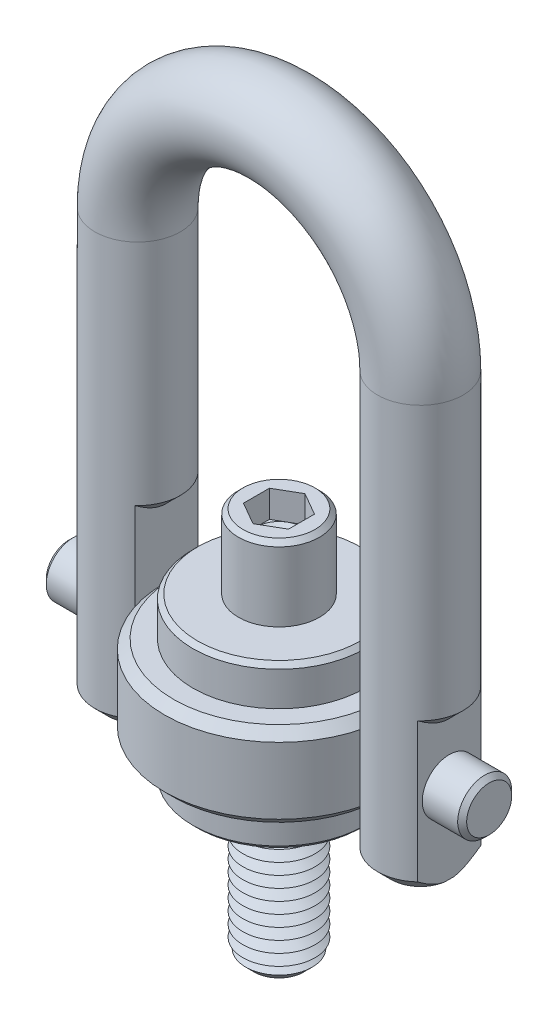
ISO-10303-21;
HEADER;
FILE_DESCRIPTION(('STEP AP214'),'2;1');
FILE_NAME('part.step','',(''),(''),'','','');
FILE_SCHEMA(('AUTOMOTIVE_DESIGN { 1 0 10303 214 1 1 1 1 }'));
ENDSEC;
DATA;
#1=APPLICATION_CONTEXT('core data for automotive mechanical design processes');
#2=APPLICATION_PROTOCOL_DEFINITION('international standard','automotive_design',2000,#1);
#3=PRODUCT_CONTEXT('',#1,'mechanical');
#4=PRODUCT('Part','Part','',(#3));
#5=PRODUCT_RELATED_PRODUCT_CATEGORY('part','',(#4));
#6=PRODUCT_DEFINITION_FORMATION('','',#4);
#7=PRODUCT_DEFINITION_CONTEXT('part definition',#1,'design');
#8=PRODUCT_DEFINITION('design','',#6,#7);
#9=PRODUCT_DEFINITION_SHAPE('','',#8);
#10=(LENGTH_UNIT() NAMED_UNIT(*) SI_UNIT(.MILLI.,.METRE.));
#11=(NAMED_UNIT(*) PLANE_ANGLE_UNIT() SI_UNIT($,.RADIAN.));
#12=(NAMED_UNIT(*) SI_UNIT($,.STERADIAN.) SOLID_ANGLE_UNIT());
#13=UNCERTAINTY_MEASURE_WITH_UNIT(LENGTH_MEASURE(1.E-05),#10,'distance_accuracy_value','');
#14=(GEOMETRIC_REPRESENTATION_CONTEXT(3) GLOBAL_UNCERTAINTY_ASSIGNED_CONTEXT((#13)) GLOBAL_UNIT_ASSIGNED_CONTEXT((#10,
#11,#12)) REPRESENTATION_CONTEXT('',''));
#15=CARTESIAN_POINT('',(0.,0.,0.));
#16=DIRECTION('',(0.,0.,1.));
#17=DIRECTION('',(1.,0.,0.));
#18=AXIS2_PLACEMENT_3D('',#15,#16,#17);
#19=CARTESIAN_POINT('',(23.35,0.,0.));
#20=DIRECTION('',(-1.,0.,0.));
#21=DIRECTION('',(0.,0.,1.));
#22=AXIS2_PLACEMENT_3D('',#19,#20,#21);
#23=CYLINDRICAL_SURFACE('',#22,3.);
#24=CARTESIAN_POINT('',(-22.85,0.,0.));
#25=DIRECTION('',(1.,0.,0.));
#26=DIRECTION('',(0.,0.,-1.));
#27=AXIS2_PLACEMENT_3D('',#24,#25,#26);
#28=CIRCLE('',#27,3.);
#29=CARTESIAN_POINT('',(-22.85,0.,-3.));
#30=VERTEX_POINT('',#29);
#31=EDGE_CURVE('P0_E25',#30,#30,#28,.T.);
#32=ORIENTED_EDGE('',*,*,#31,.T.);
#33=EDGE_LOOP('',(#32));
#34=FACE_BOUND('',#33,.T.);
#35=CARTESIAN_POINT('',(22.85,0.,0.));
#36=DIRECTION('',(1.,0.,0.));
#37=DIRECTION('',(0.,0.,-1.));
#38=AXIS2_PLACEMENT_3D('',#35,#36,#37);
#39=CIRCLE('',#38,3.);
#40=CARTESIAN_POINT('',(22.85,0.,-3.));
#41=VERTEX_POINT('',#40);
#42=EDGE_CURVE('P0_E29',#41,#41,#39,.F.);
#43=ORIENTED_EDGE('',*,*,#42,.T.);
#44=EDGE_LOOP('',(#43));
#45=FACE_BOUND('',#44,.T.);
#46=ADVANCED_FACE('P0_F14',(#34,#45),#23,.T.);
#47=CARTESIAN_POINT('',(23.35,0.,0.));
#48=DIRECTION('',(1.,0.,0.));
#49=DIRECTION('',(0.,0.,-1.));
#50=AXIS2_PLACEMENT_3D('',#47,#48,#49);
#51=PLANE('',#50);
#52=CARTESIAN_POINT('',(23.35,0.,0.));
#53=DIRECTION('',(1.,0.,0.));
#54=DIRECTION('',(0.,0.,-1.));
#55=AXIS2_PLACEMENT_3D('',#52,#53,#54);
#56=CIRCLE('',#55,2.5);
#57=CARTESIAN_POINT('',(23.35,0.,-2.5));
#58=VERTEX_POINT('',#57);
#59=EDGE_CURVE('P0_E10',#58,#58,#56,.T.);
#60=ORIENTED_EDGE('',*,*,#59,.T.);
#61=EDGE_LOOP('',(#60));
#62=FACE_BOUND('',#61,.T.);
#63=ADVANCED_FACE('P0_F46',(#62),#51,.T.);
#64=CARTESIAN_POINT('',(-23.35,0.,0.));
#65=DIRECTION('',(1.,0.,0.));
#66=DIRECTION('',(0.,0.,-1.));
#67=AXIS2_PLACEMENT_3D('',#64,#65,#66);
#68=PLANE('',#67);
#69=CARTESIAN_POINT('',(-23.35,0.,0.));
#70=DIRECTION('',(1.,0.,0.));
#71=DIRECTION('',(0.,0.,-1.));
#72=AXIS2_PLACEMENT_3D('',#69,#70,#71);
#73=CIRCLE('',#72,2.49999999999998);
#74=CARTESIAN_POINT('',(-23.35,0.,-2.49999999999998));
#75=VERTEX_POINT('',#74);
#76=EDGE_CURVE('P0_E21',#75,#75,#73,.F.);
#77=ORIENTED_EDGE('',*,*,#76,.T.);
#78=EDGE_LOOP('',(#77));
#79=FACE_BOUND('',#78,.T.);
#80=ADVANCED_FACE('P0_F43',(#79),#68,.F.);
#81=CARTESIAN_POINT('',(-22.85,0.,0.));
#82=DIRECTION('',(1.,0.,0.));
#83=DIRECTION('',(0.,0.,-1.));
#84=AXIS2_PLACEMENT_3D('',#81,#82,#83);
#85=CONICAL_SURFACE('',#84,3.,0.785398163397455);
#86=ORIENTED_EDGE('',*,*,#76,.F.);
#87=EDGE_LOOP('',(#86));
#88=FACE_BOUND('',#87,.T.);
#89=ORIENTED_EDGE('',*,*,#31,.F.);
#90=EDGE_LOOP('',(#89));
#91=FACE_BOUND('',#90,.T.);
#92=ADVANCED_FACE('P0_F38',(#88,#91),#85,.T.);
#93=CARTESIAN_POINT('',(23.35,0.,0.));
#94=DIRECTION('',(-1.,0.,0.));
#95=DIRECTION('',(0.,0.,1.));
#96=AXIS2_PLACEMENT_3D('',#93,#94,#95);
#97=CONICAL_SURFACE('',#96,2.5,0.785398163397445);
#98=ORIENTED_EDGE('',*,*,#42,.F.);
#99=EDGE_LOOP('',(#98));
#100=FACE_BOUND('',#99,.T.);
#101=ORIENTED_EDGE('',*,*,#59,.F.);
#102=EDGE_LOOP('',(#101));
#103=FACE_BOUND('',#102,.T.);
#104=ADVANCED_FACE('P0_F16',(#100,#103),#97,.T.);
#105=CLOSED_SHELL('',(#46,#63,#80,#92,#104));
#106=MANIFOLD_SOLID_BREP('P0_B1',#105);
#107=CARTESIAN_POINT('',(15.7,-8.99999999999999,0.));
#108=DIRECTION('',(0.,-1.,0.));
#109=DIRECTION('',(0.,0.,1.));
#110=AXIS2_PLACEMENT_3D('',#107,#108,#109);
#111=PLANE('',#110);
#112=DIRECTION('',(0.,0.,-1.));
#113=VECTOR('',#112,1.);
#114=CARTESIAN_POINT('',(12.4886918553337,-9.,3.5));
#115=LINE('',#114,#113);
#116=CARTESIAN_POINT('',(12.4886918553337,-9.,0.499999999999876));
#117=VERTEX_POINT('',#116);
#118=CARTESIAN_POINT('',(12.4886918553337,-9.,-0.500000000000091));
#119=VERTEX_POINT('',#118);
#120=EDGE_CURVE('P1_E132',#117,#119,#115,.T.);
#121=ORIENTED_EDGE('',*,*,#120,.T.);
#122=CARTESIAN_POINT('',(15.7,-8.99999999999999,0.));
#123=DIRECTION('',(0.,-1.,0.));
#124=DIRECTION('',(0.,0.,-1.));
#125=AXIS2_PLACEMENT_3D('',#122,#123,#124);
#126=CIRCLE('',#125,3.25000000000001);
#127=CARTESIAN_POINT('',(18.9113081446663,-9.,-0.500000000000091));
#128=VERTEX_POINT('',#127);
#129=EDGE_CURVE('P1_E192',#119,#128,#126,.T.);
#130=ORIENTED_EDGE('',*,*,#129,.T.);
#131=DIRECTION('',(0.,0.,1.));
#132=VECTOR('',#131,1.);
#133=CARTESIAN_POINT('',(18.9113081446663,-9.,3.5));
#134=LINE('',#133,#132);
#135=CARTESIAN_POINT('',(18.9113081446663,-9.,0.49999999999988));
#136=VERTEX_POINT('',#135);
#137=EDGE_CURVE('P1_E315',#128,#136,#134,.T.);
#138=ORIENTED_EDGE('',*,*,#137,.T.);
#139=CARTESIAN_POINT('',(15.7,-8.99999999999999,0.));
#140=DIRECTION('',(0.,-1.,0.));
#141=DIRECTION('',(0.,0.,-1.));
#142=AXIS2_PLACEMENT_3D('',#139,#140,#141);
#143=CIRCLE('',#142,3.24999999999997);
#144=CARTESIAN_POINT('',(15.7,-8.99999999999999,3.24999999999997));
#145=VERTEX_POINT('',#144);
#146=EDGE_CURVE('P1_E370',#136,#145,#143,.T.);
#147=ORIENTED_EDGE('',*,*,#146,.T.);
#148=CARTESIAN_POINT('',(15.7,-8.99999999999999,0.));
#149=DIRECTION('',(0.,-1.,0.));
#150=DIRECTION('',(0.,0.,-1.));
#151=AXIS2_PLACEMENT_3D('',#148,#149,#150);
#152=CIRCLE('',#151,3.24999999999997);
#153=EDGE_CURVE('P1_E369',#145,#117,#152,.T.);
#154=ORIENTED_EDGE('',*,*,#153,.T.);
#155=EDGE_LOOP('',(#121,#130,#138,#147,#154));
#156=FACE_BOUND('',#155,.T.);
#157=ADVANCED_FACE('P1_F16',(#156),#111,.T.);
#158=CARTESIAN_POINT('',(15.7,38.35,0.));
#159=DIRECTION('',(0.,-1.,0.));
#160=DIRECTION('',(0.,0.,-1.));
#161=AXIS2_PLACEMENT_3D('',#158,#159,#160);
#162=CYLINDRICAL_SURFACE('',#161,4.75);
#163=CARTESIAN_POINT('',(15.7,38.35,0.));
#164=DIRECTION('',(0.,-1.,0.));
#165=DIRECTION('',(0.,0.,1.));
#166=AXIS2_PLACEMENT_3D('',#163,#164,#165);
#167=CIRCLE('',#166,4.75);
#168=CARTESIAN_POINT('',(20.45,38.35,0.));
#169=VERTEX_POINT('',#168);
#170=EDGE_CURVE('P1_E143',#169,#169,#167,.T.);
#171=ORIENTED_EDGE('',*,*,#170,.T.);
#172=EDGE_LOOP('',(#171));
#173=FACE_BOUND('',#172,.T.);
#174=DIRECTION('',(0.,-1.,0.));
#175=VECTOR('',#174,1.);
#176=CARTESIAN_POINT('',(18.9113081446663,6.,-3.5));
#177=LINE('',#176,#175);
#178=CARTESIAN_POINT('',(18.9113081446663,8.00000000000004,-3.5));
#179=VERTEX_POINT('',#178);
#180=CARTESIAN_POINT('',(18.9113081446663,-7.5,-3.5));
#181=VERTEX_POINT('',#180);
#182=EDGE_CURVE('P1_E328',#179,#181,#177,.T.);
#183=ORIENTED_EDGE('',*,*,#182,.T.);
#184=CARTESIAN_POINT('',(15.7,-7.5,0.));
#185=DIRECTION('',(0.,-1.,0.));
#186=DIRECTION('',(0.,0.,-1.));
#187=AXIS2_PLACEMENT_3D('',#184,#185,#186);
#188=CIRCLE('',#187,4.75);
#189=CARTESIAN_POINT('',(12.4886918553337,-7.5,-3.5));
#190=VERTEX_POINT('',#189);
#191=EDGE_CURVE('P1_E128',#181,#190,#188,.F.);
#192=ORIENTED_EDGE('',*,*,#191,.T.);
#193=DIRECTION('',(0.,-1.,0.));
#194=VECTOR('',#193,1.);
#195=CARTESIAN_POINT('',(12.4886918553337,11.,-3.5));
#196=LINE('',#195,#194);
#197=CARTESIAN_POINT('',(12.4886918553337,13.,-3.5));
#198=VERTEX_POINT('',#197);
#199=EDGE_CURVE('P1_E120',#198,#190,#196,.T.);
#200=ORIENTED_EDGE('',*,*,#199,.F.);
#201=CARTESIAN_POINT('',(15.7,13.,0.));
#202=DIRECTION('',(0.,-1.,0.));
#203=DIRECTION('',(0.,0.,-1.));
#204=AXIS2_PLACEMENT_3D('',#201,#202,#203);
#205=CIRCLE('',#204,4.75);
#206=CARTESIAN_POINT('',(12.4886918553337,13.,3.5));
#207=VERTEX_POINT('',#206);
#208=EDGE_CURVE('P1_E126',#198,#207,#205,.F.);
#209=ORIENTED_EDGE('',*,*,#208,.T.);
#210=DIRECTION('',(0.,-1.,0.));
#211=VECTOR('',#210,1.);
#212=CARTESIAN_POINT('',(12.4886918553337,11.,3.5));
#213=LINE('',#212,#211);
#214=CARTESIAN_POINT('',(12.4886918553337,-7.49999999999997,3.5));
#215=VERTEX_POINT('',#214);
#216=EDGE_CURVE('P1_E131',#207,#215,#213,.T.);
#217=ORIENTED_EDGE('',*,*,#216,.T.);
#218=CARTESIAN_POINT('',(15.7,-7.49999999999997,0.));
#219=DIRECTION('',(0.,-1.,0.));
#220=DIRECTION('',(0.,0.,-1.));
#221=AXIS2_PLACEMENT_3D('',#218,#219,#220);
#222=CIRCLE('',#221,4.75);
#223=CARTESIAN_POINT('',(15.7,-7.49999999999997,4.75));
#224=VERTEX_POINT('',#223);
#225=EDGE_CURVE('P1_E530',#215,#224,#222,.F.);
#226=ORIENTED_EDGE('',*,*,#225,.T.);
#227=CARTESIAN_POINT('',(15.7,-7.49999999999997,0.));
#228=DIRECTION('',(0.,-1.,0.));
#229=DIRECTION('',(0.,0.,-1.));
#230=AXIS2_PLACEMENT_3D('',#227,#228,#229);
#231=CIRCLE('',#230,4.75);
#232=CARTESIAN_POINT('',(18.9113081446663,-7.49999999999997,3.5));
#233=VERTEX_POINT('',#232);
#234=EDGE_CURVE('P1_E528',#224,#233,#231,.F.);
#235=ORIENTED_EDGE('',*,*,#234,.T.);
#236=DIRECTION('',(0.,-1.,0.));
#237=VECTOR('',#236,1.);
#238=CARTESIAN_POINT('',(18.9113081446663,6.,3.5));
#239=LINE('',#238,#237);
#240=CARTESIAN_POINT('',(18.9113081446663,8.00000000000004,3.5));
#241=VERTEX_POINT('',#240);
#242=EDGE_CURVE('P1_E327',#241,#233,#239,.T.);
#243=ORIENTED_EDGE('',*,*,#242,.F.);
#244=CARTESIAN_POINT('',(15.7,8.00000000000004,0.));
#245=DIRECTION('',(0.,-1.,0.));
#246=DIRECTION('',(0.,0.,-1.));
#247=AXIS2_PLACEMENT_3D('',#244,#245,#246);
#248=CIRCLE('',#247,4.75);
#249=EDGE_CURVE('P1_E142',#241,#179,#248,.F.);
#250=ORIENTED_EDGE('',*,*,#249,.T.);
#251=EDGE_LOOP('',(#183,#192,#200,#209,#217,#226,#235,#243,#250));
#252=FACE_BOUND('',#251,.T.);
#253=ADVANCED_FACE('P1_F123',(#173,#252),#162,.T.);
#254=CARTESIAN_POINT('',(-15.7,-9.,0.));
#255=DIRECTION('',(0.,1.,0.));
#256=DIRECTION('',(0.,0.,1.));
#257=AXIS2_PLACEMENT_3D('',#254,#255,#256);
#258=PLANE('',#257);
#259=DIRECTION('',(0.,0.,1.));
#260=VECTOR('',#259,1.);
#261=CARTESIAN_POINT('',(-18.9113081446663,-9.,3.5));
#262=LINE('',#261,#260);
#263=CARTESIAN_POINT('',(-18.9113081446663,-9.,-0.499999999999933));
#264=VERTEX_POINT('',#263);
#265=CARTESIAN_POINT('',(-18.9113081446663,-9.,0.500000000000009));
#266=VERTEX_POINT('',#265);
#267=EDGE_CURVE('P1_E334',#264,#266,#262,.T.);
#268=ORIENTED_EDGE('',*,*,#267,.F.);
#269=CARTESIAN_POINT('',(-15.7,-9.,0.));
#270=DIRECTION('',(0.,1.,0.));
#271=DIRECTION('',(0.,0.,1.));
#272=AXIS2_PLACEMENT_3D('',#269,#270,#271);
#273=CIRCLE('',#272,3.24999999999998);
#274=CARTESIAN_POINT('',(-12.4886918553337,-9.,-0.499999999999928));
#275=VERTEX_POINT('',#274);
#276=EDGE_CURVE('P1_E40',#264,#275,#273,.F.);
#277=ORIENTED_EDGE('',*,*,#276,.T.);
#278=DIRECTION('',(0.,0.,-1.));
#279=VECTOR('',#278,1.);
#280=CARTESIAN_POINT('',(-12.4886918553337,-9.,3.5));
#281=LINE('',#280,#279);
#282=CARTESIAN_POINT('',(-12.4886918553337,-9.,0.500000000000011));
#283=VERTEX_POINT('',#282);
#284=EDGE_CURVE('P1_E303',#283,#275,#281,.T.);
#285=ORIENTED_EDGE('',*,*,#284,.F.);
#286=CARTESIAN_POINT('',(-15.7,-9.,0.));
#287=DIRECTION('',(0.,1.,0.));
#288=DIRECTION('',(0.,0.,1.));
#289=AXIS2_PLACEMENT_3D('',#286,#287,#288);
#290=CIRCLE('',#289,3.24999999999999);
#291=CARTESIAN_POINT('',(-15.7,-9.,3.24999999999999));
#292=VERTEX_POINT('',#291);
#293=EDGE_CURVE('P1_E34',#283,#292,#290,.F.);
#294=ORIENTED_EDGE('',*,*,#293,.T.);
#295=CARTESIAN_POINT('',(-15.7,-9.,0.));
#296=DIRECTION('',(0.,1.,0.));
#297=DIRECTION('',(0.,0.,1.));
#298=AXIS2_PLACEMENT_3D('',#295,#296,#297);
#299=CIRCLE('',#298,3.24999999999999);
#300=EDGE_CURVE('P1_E298',#292,#266,#299,.F.);
#301=ORIENTED_EDGE('',*,*,#300,.T.);
#302=EDGE_LOOP('',(#268,#277,#285,#294,#301));
#303=FACE_BOUND('',#302,.T.);
#304=ADVANCED_FACE('P1_F239',(#303),#258,.F.);
#305=CARTESIAN_POINT('',(-15.7,-9.,0.));
#306=DIRECTION('',(0.,1.,0.));
#307=DIRECTION('',(0.,0.,1.));
#308=AXIS2_PLACEMENT_3D('',#305,#306,#307);
#309=CYLINDRICAL_SURFACE('',#308,4.75);
#310=DIRECTION('',(0.,-1.,0.));
#311=VECTOR('',#310,1.);
#312=CARTESIAN_POINT('',(-12.4886918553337,11.,-3.5));
#313=LINE('',#312,#311);
#314=CARTESIAN_POINT('',(-12.4886918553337,13.,-3.5));
#315=VERTEX_POINT('',#314);
#316=CARTESIAN_POINT('',(-12.4886918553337,-7.49999999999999,-3.5));
#317=VERTEX_POINT('',#316);
#318=EDGE_CURVE('P1_E340',#315,#317,#313,.T.);
#319=ORIENTED_EDGE('',*,*,#318,.T.);
#320=CARTESIAN_POINT('',(-15.7,-7.49999999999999,0.));
#321=DIRECTION('',(0.,1.,0.));
#322=DIRECTION('',(0.,0.,1.));
#323=AXIS2_PLACEMENT_3D('',#320,#321,#322);
#324=CIRCLE('',#323,4.75);
#325=CARTESIAN_POINT('',(-18.9113081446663,-7.49999999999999,-3.5));
#326=VERTEX_POINT('',#325);
#327=EDGE_CURVE('P1_E287',#317,#326,#324,.T.);
#328=ORIENTED_EDGE('',*,*,#327,.T.);
#329=DIRECTION('',(0.,-1.,0.));
#330=VECTOR('',#329,1.);
#331=CARTESIAN_POINT('',(-18.9113081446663,6.,-3.5));
#332=LINE('',#331,#330);
#333=CARTESIAN_POINT('',(-18.9113081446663,8.00000000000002,-3.5));
#334=VERTEX_POINT('',#333);
#335=EDGE_CURVE('P1_E337',#334,#326,#332,.T.);
#336=ORIENTED_EDGE('',*,*,#335,.F.);
#337=CARTESIAN_POINT('',(-15.7,8.00000000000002,0.));
#338=DIRECTION('',(0.,-1.,0.));
#339=DIRECTION('',(0.,0.,-1.));
#340=AXIS2_PLACEMENT_3D('',#337,#338,#339);
#341=CIRCLE('',#340,4.75);
#342=CARTESIAN_POINT('',(-18.9113081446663,8.00000000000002,3.5));
#343=VERTEX_POINT('',#342);
#344=EDGE_CURVE('P1_E146',#334,#343,#341,.F.);
#345=ORIENTED_EDGE('',*,*,#344,.T.);
#346=DIRECTION('',(0.,-1.,0.));
#347=VECTOR('',#346,1.);
#348=CARTESIAN_POINT('',(-18.9113081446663,6.,3.5));
#349=LINE('',#348,#347);
#350=CARTESIAN_POINT('',(-18.9113081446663,-7.50000000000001,3.5));
#351=VERTEX_POINT('',#350);
#352=EDGE_CURVE('P1_E308',#343,#351,#349,.T.);
#353=ORIENTED_EDGE('',*,*,#352,.T.);
#354=CARTESIAN_POINT('',(-15.7,-7.50000000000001,0.));
#355=DIRECTION('',(0.,1.,0.));
#356=DIRECTION('',(0.,0.,1.));
#357=AXIS2_PLACEMENT_3D('',#354,#355,#356);
#358=CIRCLE('',#357,4.75);
#359=CARTESIAN_POINT('',(-15.7,-7.50000000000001,4.75));
#360=VERTEX_POINT('',#359);
#361=EDGE_CURVE('P1_E284',#351,#360,#358,.T.);
#362=ORIENTED_EDGE('',*,*,#361,.T.);
#363=CARTESIAN_POINT('',(-15.7,-7.50000000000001,0.));
#364=DIRECTION('',(0.,1.,0.));
#365=DIRECTION('',(0.,0.,1.));
#366=AXIS2_PLACEMENT_3D('',#363,#364,#365);
#367=CIRCLE('',#366,4.75);
#368=CARTESIAN_POINT('',(-12.4886918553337,-7.50000000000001,3.5));
#369=VERTEX_POINT('',#368);
#370=EDGE_CURVE('P1_E277',#360,#369,#367,.T.);
#371=ORIENTED_EDGE('',*,*,#370,.T.);
#372=DIRECTION('',(0.,-1.,0.));
#373=VECTOR('',#372,1.);
#374=CARTESIAN_POINT('',(-12.4886918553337,11.,3.5));
#375=LINE('',#374,#373);
#376=CARTESIAN_POINT('',(-12.4886918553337,13.,3.5));
#377=VERTEX_POINT('',#376);
#378=EDGE_CURVE('P1_E305',#377,#369,#375,.T.);
#379=ORIENTED_EDGE('',*,*,#378,.F.);
#380=CARTESIAN_POINT('',(-15.7,13.,0.));
#381=DIRECTION('',(0.,-1.,0.));
#382=DIRECTION('',(0.,0.,-1.));
#383=AXIS2_PLACEMENT_3D('',#380,#381,#382);
#384=CIRCLE('',#383,4.75);
#385=EDGE_CURVE('P1_E155',#377,#315,#384,.F.);
#386=ORIENTED_EDGE('',*,*,#385,.T.);
#387=EDGE_LOOP('',(#319,#328,#336,#345,#353,#362,#371,#379,#386));
#388=FACE_BOUND('',#387,.T.);
#389=CARTESIAN_POINT('',(-15.7,38.35,0.));
#390=DIRECTION('',(0.,1.,0.));
#391=DIRECTION('',(0.,0.,1.));
#392=AXIS2_PLACEMENT_3D('',#389,#390,#391);
#393=CIRCLE('',#392,4.75);
#394=CARTESIAN_POINT('',(-20.4500000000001,38.35,0.));
#395=VERTEX_POINT('',#394);
#396=EDGE_CURVE('P1_E149',#395,#395,#393,.T.);
#397=ORIENTED_EDGE('',*,*,#396,.F.);
#398=EDGE_LOOP('',(#397));
#399=FACE_BOUND('',#398,.T.);
#400=ADVANCED_FACE('P1_F241',(#388,#399),#309,.T.);
#401=CARTESIAN_POINT('',(0.,38.35,0.));
#402=DIRECTION('',(0.,0.,-1.));
#403=DIRECTION('',(-1.,0.,0.));
#404=AXIS2_PLACEMENT_3D('',#401,#402,#403);
#405=TOROIDAL_SURFACE('',#404,15.7,4.75);
#406=CARTESIAN_POINT('',(0.,38.35,0.));
#407=DIRECTION('',(0.,0.,-1.));
#408=DIRECTION('',(-1.,0.,0.));
#409=AXIS2_PLACEMENT_3D('',#406,#407,#408);
#410=CIRCLE('',#409,20.45);
#411=EDGE_CURVE('',#395,#169,#410,.T.);
#412=ORIENTED_EDGE('',*,*,#396,.T.);
#413=ORIENTED_EDGE('',*,*,#170,.F.);
#414=ORIENTED_EDGE('',*,*,#411,.T.);
#415=ORIENTED_EDGE('',*,*,#411,.F.);
#416=EDGE_LOOP('',(#412,#414,#413,#415));
#417=FACE_BOUND('',#416,.T.);
#418=ADVANCED_FACE('P1_F237',(#417),#405,.T.);
#419=CARTESIAN_POINT('',(-12.4886918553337,11.,3.5));
#420=DIRECTION('',(-1.,0.,0.));
#421=DIRECTION('',(0.,0.,1.));
#422=AXIS2_PLACEMENT_3D('',#419,#420,#421);
#423=PLANE('',#422);
#424=CARTESIAN_POINT('',(-12.4886918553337,0.,0.));
#425=DIRECTION('',(-1.,0.,0.));
#426=DIRECTION('',(0.,0.,1.));
#427=AXIS2_PLACEMENT_3D('',#424,#425,#426);
#428=CIRCLE('',#427,3.);
#429=CARTESIAN_POINT('',(-12.4886918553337,0.,3.));
#430=VERTEX_POINT('',#429);
#431=EDGE_CURVE('P1_E313',#430,#430,#428,.T.);
#432=ORIENTED_EDGE('',*,*,#431,.T.);
#433=EDGE_LOOP('',(#432));
#434=FACE_BOUND('',#433,.T.);
#435=ORIENTED_EDGE('',*,*,#284,.T.);
#436=CARTESIAN_POINT('',(-12.4886918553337,-9.,-0.49999999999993));
#437=CARTESIAN_POINT('',(-12.4886918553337,-8.96431755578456,-0.732126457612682));
#438=CARTESIAN_POINT('',(-12.4886918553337,-8.90504566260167,-0.958727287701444));
#439=CARTESIAN_POINT('',(-12.4886918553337,-8.79128625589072,-1.28868510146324));
#440=CARTESIAN_POINT('',(-12.4886918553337,-8.74955307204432,-1.39638648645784));
#441=CARTESIAN_POINT('',(-12.4886918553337,-8.65943719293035,-1.6090118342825));
#442=CARTESIAN_POINT('',(-12.4886918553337,-8.61104945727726,-1.71393361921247));
#443=CARTESIAN_POINT('',(-12.4886918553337,-8.48733927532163,-1.9651059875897));
#444=CARTESIAN_POINT('',(-12.4886918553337,-8.40929694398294,-2.11001256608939));
#445=CARTESIAN_POINT('',(-12.4886918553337,-8.24543028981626,-2.39535143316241));
#446=CARTESIAN_POINT('',(-12.4886918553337,-8.1596031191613,-2.53578205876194));
#447=CARTESIAN_POINT('',(-12.4886918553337,-7.98064576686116,-2.81542735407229));
#448=CARTESIAN_POINT('',(-12.4886918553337,-7.88741276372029,-2.95457585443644));
#449=CARTESIAN_POINT('',(-12.4886918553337,-7.74431893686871,-3.16086961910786));
#450=CARTESIAN_POINT('',(-12.4886918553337,-7.69611805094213,-3.22917849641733));
#451=CARTESIAN_POINT('',(-12.4886918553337,-7.59875110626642,-3.36509430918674));
#452=CARTESIAN_POINT('',(-12.4886918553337,-7.5495851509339,-3.43270131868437));
#453=CARTESIAN_POINT('',(-12.4886918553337,-7.49999999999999,-3.5));
#454=B_SPLINE_CURVE_WITH_KNOTS('',3,(#436,#437,#438,#439,#440,#441,#442,#443,#444,#445,#446,
#447,#448,#449,#450,#451,#452,#453),.UNSPECIFIED.,.F.,.F.,(4,2,2,2,2,2,2,2,4),(0.,
0.70078895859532,1.04698521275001,1.39344514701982,1.88684041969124,2.38041691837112,
2.882781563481,3.13358381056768,3.38435932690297),.UNSPECIFIED.);
#455=EDGE_CURVE('P1_E11',#275,#317,#454,.T.);
#456=ORIENTED_EDGE('',*,*,#455,.T.);
#457=ORIENTED_EDGE('',*,*,#318,.F.);
#458=CARTESIAN_POINT('',(-12.4886918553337,13.,-3.5));
#459=CARTESIAN_POINT('',(-12.4886918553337,12.93224068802,-3.40801477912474));
#460=CARTESIAN_POINT('',(-12.4886918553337,12.8652436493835,-3.31545721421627));
#461=CARTESIAN_POINT('',(-12.4886918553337,12.7331351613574,-3.12895874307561));
#462=CARTESIAN_POINT('',(-12.4886918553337,12.6680243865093,-3.03501735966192));
#463=CARTESIAN_POINT('',(-12.4886918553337,12.5394125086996,-2.84456235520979));
#464=CARTESIAN_POINT('',(-12.4886918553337,12.475936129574,-2.74803195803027));
#465=CARTESIAN_POINT('',(-12.4886918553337,12.3518749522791,-2.55314125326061));
#466=CARTESIAN_POINT('',(-12.4886918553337,12.2912898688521,-2.4547811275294));
#467=CARTESIAN_POINT('',(-12.4886918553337,12.1713582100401,-2.25199851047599));
#468=CARTESIAN_POINT('',(-12.4886918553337,12.1121551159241,-2.14749003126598));
#469=CARTESIAN_POINT('',(-12.4886918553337,11.998616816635,-1.93587248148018));
#470=CARTESIAN_POINT('',(-12.4886918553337,11.9442825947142,-1.8287628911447));
#471=CARTESIAN_POINT('',(-12.4886918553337,11.7908947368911,-1.50392697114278));
#472=CARTESIAN_POINT('',(-12.4886918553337,11.7007906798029,-1.28161787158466));
#473=CARTESIAN_POINT('',(-12.4886918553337,11.6006181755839,-0.960187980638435));
#474=CARTESIAN_POINT('',(-12.4886918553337,11.5747280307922,-0.865951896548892));
#475=CARTESIAN_POINT('',(-12.4886918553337,11.5303202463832,-0.675690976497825));
#476=CARTESIAN_POINT('',(-12.4886918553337,11.5118050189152,-0.579665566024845));
#477=CARTESIAN_POINT('',(-12.4886918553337,11.4831972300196,-0.387316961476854));
#478=CARTESIAN_POINT('',(-12.4886918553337,11.4730238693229,-0.291005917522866));
#479=CARTESIAN_POINT('',(-12.4886918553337,11.4613558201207,-0.0978925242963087));
#480=CARTESIAN_POINT('',(-12.4886918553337,11.4598568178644,-0.00109044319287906));
#481=CARTESIAN_POINT('',(-12.4886918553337,11.4649759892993,0.171134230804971));
#482=CARTESIAN_POINT('',(-12.4886918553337,11.4698941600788,0.246612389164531));
#483=CARTESIAN_POINT('',(-12.4886918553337,11.4848987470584,0.39708899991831));
#484=CARTESIAN_POINT('',(-12.4886918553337,11.4949879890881,0.472087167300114));
#485=CARTESIAN_POINT('',(-12.4886918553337,11.5270657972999,0.663201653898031));
#486=CARTESIAN_POINT('',(-12.4886918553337,11.5525551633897,0.778738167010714));
#487=CARTESIAN_POINT('',(-12.4886918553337,11.6137255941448,1.00712274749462));
#488=CARTESIAN_POINT('',(-12.4886918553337,11.6494159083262,1.1199682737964));
#489=CARTESIAN_POINT('',(-12.4886918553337,11.7294300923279,1.34346895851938));
#490=CARTESIAN_POINT('',(-12.4886918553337,11.7738164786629,1.45410145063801));
#491=CARTESIAN_POINT('',(-12.4886918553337,11.8693685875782,1.67241304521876));
#492=CARTESIAN_POINT('',(-12.4886918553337,11.9205369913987,1.78009095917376));
#493=CARTESIAN_POINT('',(-12.4886918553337,12.0473112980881,2.03039834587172));
#494=CARTESIAN_POINT('',(-12.4886918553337,12.1251510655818,2.17189014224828));
#495=CARTESIAN_POINT('',(-12.4886918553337,12.2880330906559,2.45071555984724));
#496=CARTESIAN_POINT('',(-12.4886918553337,12.3730795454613,2.58804669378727));
#497=CARTESIAN_POINT('',(-12.4886918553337,12.5464350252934,2.85605395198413));
#498=CARTESIAN_POINT('',(-12.4886918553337,12.6346202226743,2.98681063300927));
#499=CARTESIAN_POINT('',(-12.4886918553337,12.7697252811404,3.18081056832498));
#500=CARTESIAN_POINT('',(-12.4886918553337,12.8151953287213,3.24507258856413));
#501=CARTESIAN_POINT('',(-12.4886918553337,12.9069862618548,3.37298099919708));
#502=CARTESIAN_POINT('',(-12.4886918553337,12.9533070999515,3.43662742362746));
#503=CARTESIAN_POINT('',(-12.4886918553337,13.,3.5));
#504=B_SPLINE_CURVE_WITH_KNOTS('',3,(#458,#459,#460,#461,#462,#463,#464,#465,#466,#467,#468,
#469,#470,#471,#472,#473,#474,#475,#476,#477,#478,#479,#480,#481,#482,#483,#484,#485,#486,#487,
#488,#489,#490,#491,#492,#493,#494,#495,#496,#497,#498,#499,#500,#501,#502,#503),.UNSPECIFIED.,
.F.,.F.,(4,2,2,2,2,2,2,2,2,2,2,2,2,2,2,2,2,2,2,2,2,2,4),(0.,0.342752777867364,0.685626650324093,
1.03217450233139,1.37868809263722,1.73889082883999,2.09916614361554,2.81593528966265,
3.10888520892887,3.40193086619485,3.69210339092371,3.98213160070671,4.20886770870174,
4.43572785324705,4.79008595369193,5.14476638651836,5.50209695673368,5.85956921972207,
6.34373165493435,6.82817803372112,7.30122722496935,7.53738755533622,7.77353475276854),.UNSPECIFIED.);
#505=EDGE_CURVE('P1_E138',#315,#377,#504,.T.);
#506=ORIENTED_EDGE('',*,*,#505,.T.);
#507=ORIENTED_EDGE('',*,*,#378,.T.);
#508=CARTESIAN_POINT('',(-12.4886918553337,-7.50000000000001,3.5));
#509=CARTESIAN_POINT('',(-12.4886918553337,-7.57030863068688,3.40455050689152));
#510=CARTESIAN_POINT('',(-12.4886918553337,-7.63979934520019,3.30848560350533));
#511=CARTESIAN_POINT('',(-12.4886918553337,-7.77674009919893,3.11485120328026));
#512=CARTESIAN_POINT('',(-12.4886918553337,-7.84418923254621,3.01728106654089));
#513=CARTESIAN_POINT('',(-12.4886918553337,-7.97730741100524,2.81936359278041));
#514=CARTESIAN_POINT('',(-12.4886918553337,-8.0429487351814,2.71899751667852));
#515=CARTESIAN_POINT('',(-12.4886918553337,-8.17104078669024,2.51626462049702));
#516=CARTESIAN_POINT('',(-12.4886918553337,-8.23349196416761,2.41389808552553));
#517=CARTESIAN_POINT('',(-12.4886918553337,-8.3523192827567,2.21042807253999));
#518=CARTESIAN_POINT('',(-12.4886918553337,-8.40883129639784,2.10940492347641));
#519=CARTESIAN_POINT('',(-12.4886918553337,-8.51721793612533,1.90491073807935));
#520=CARTESIAN_POINT('',(-12.4886918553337,-8.5690915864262,1.80143919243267));
#521=CARTESIAN_POINT('',(-12.4886918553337,-8.71561212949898,1.48777751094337));
#522=CARTESIAN_POINT('',(-12.4886918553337,-8.80179560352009,1.27329531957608));
#523=CARTESIAN_POINT('',(-12.4886918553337,-8.88437945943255,1.00833190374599));
#524=CARTESIAN_POINT('',(-12.4886918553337,-8.89769655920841,0.962993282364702));
#525=CARTESIAN_POINT('',(-12.4886918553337,-8.92273118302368,0.871859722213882));
#526=CARTESIAN_POINT('',(-12.4886918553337,-8.93444830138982,0.826064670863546));
#527=CARTESIAN_POINT('',(-12.4886918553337,-8.95623469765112,0.733765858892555));
#528=CARTESIAN_POINT('',(-12.4886918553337,-8.96629265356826,0.687259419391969));
#529=CARTESIAN_POINT('',(-12.4886918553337,-8.98455961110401,0.593886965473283));
#530=CARTESIAN_POINT('',(-12.4886918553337,-8.99276867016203,0.54702096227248));
#531=CARTESIAN_POINT('',(-12.4886918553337,-9.,0.500000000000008));
#532=B_SPLINE_CURVE_WITH_KNOTS('',3,(#508,#509,#510,#511,#512,#513,#514,#515,#516,#517,#518,
#519,#520,#521,#522,#523,#524,#525,#526,#527,#528,#529,#530,#531),.UNSPECIFIED.,.F.,.F.,(4,2,2,
2,2,2,2,2,2,2,2,4),(0.,0.355658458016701,0.711472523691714,1.07119821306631,1.43087300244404,
1.77801189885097,2.12522365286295,2.81598705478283,2.95772912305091,3.09950706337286,
3.24221568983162,3.38491988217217),.UNSPECIFIED.);
#533=EDGE_CURVE('P1_E26',#369,#283,#532,.T.);
#534=ORIENTED_EDGE('',*,*,#533,.T.);
#535=EDGE_LOOP('',(#435,#456,#457,#506,#507,#534));
#536=FACE_BOUND('',#535,.T.);
#537=ADVANCED_FACE('P1_F232',(#434,#536),#423,.F.);
#538=CARTESIAN_POINT('',(-18.9113081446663,6.,3.5));
#539=DIRECTION('',(1.,0.,0.));
#540=DIRECTION('',(0.,0.,-1.));
#541=AXIS2_PLACEMENT_3D('',#538,#539,#540);
#542=PLANE('',#541);
#543=CARTESIAN_POINT('',(-18.9113081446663,0.,0.));
#544=DIRECTION('',(1.,0.,0.));
#545=DIRECTION('',(0.,0.,-1.));
#546=AXIS2_PLACEMENT_3D('',#543,#544,#545);
#547=CIRCLE('',#546,3.);
#548=CARTESIAN_POINT('',(-18.9113081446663,0.,-3.));
#549=VERTEX_POINT('',#548);
#550=EDGE_CURVE('P1_E321',#549,#549,#547,.F.);
#551=ORIENTED_EDGE('',*,*,#550,.F.);
#552=EDGE_LOOP('',(#551));
#553=FACE_BOUND('',#552,.T.);
#554=ORIENTED_EDGE('',*,*,#335,.T.);
#555=CARTESIAN_POINT('',(-18.9113081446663,-7.49999999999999,-3.5));
#556=CARTESIAN_POINT('',(-18.9113081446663,-7.57030863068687,-3.40455050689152));
#557=CARTESIAN_POINT('',(-18.9113081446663,-7.63979934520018,-3.30848560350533));
#558=CARTESIAN_POINT('',(-18.9113081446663,-7.77674009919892,-3.11485120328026));
#559=CARTESIAN_POINT('',(-18.9113081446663,-7.8441892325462,-3.01728106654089));
#560=CARTESIAN_POINT('',(-18.9113081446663,-7.97730741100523,-2.81936359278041));
#561=CARTESIAN_POINT('',(-18.9113081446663,-8.04294873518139,-2.71899751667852));
#562=CARTESIAN_POINT('',(-18.9113081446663,-8.17104078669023,-2.51626462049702));
#563=CARTESIAN_POINT('',(-18.9113081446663,-8.2334919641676,-2.41389808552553));
#564=CARTESIAN_POINT('',(-18.9113081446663,-8.35231928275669,-2.21042807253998));
#565=CARTESIAN_POINT('',(-18.9113081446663,-8.40883129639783,-2.10940492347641));
#566=CARTESIAN_POINT('',(-18.9113081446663,-8.51721793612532,-1.90491073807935));
#567=CARTESIAN_POINT('',(-18.9113081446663,-8.56909158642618,-1.80143919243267));
#568=CARTESIAN_POINT('',(-18.9113081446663,-8.71561212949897,-1.48777751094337));
#569=CARTESIAN_POINT('',(-18.9113081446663,-8.80179560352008,-1.27329531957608));
#570=CARTESIAN_POINT('',(-18.9113081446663,-8.88437945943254,-1.00833190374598));
#571=CARTESIAN_POINT('',(-18.9113081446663,-8.8976965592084,-0.96299328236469));
#572=CARTESIAN_POINT('',(-18.9113081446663,-8.92273118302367,-0.871859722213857));
#573=CARTESIAN_POINT('',(-18.9113081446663,-8.93444830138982,-0.826064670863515));
#574=CARTESIAN_POINT('',(-18.9113081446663,-8.95623469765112,-0.733765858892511));
#575=CARTESIAN_POINT('',(-18.9113081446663,-8.96629265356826,-0.687259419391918));
#576=CARTESIAN_POINT('',(-18.9113081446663,-8.98455961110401,-0.593886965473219));
#577=CARTESIAN_POINT('',(-18.9113081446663,-8.99276867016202,-0.547020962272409));
#578=CARTESIAN_POINT('',(-18.9113081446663,-9.,-0.49999999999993));
#579=B_SPLINE_CURVE_WITH_KNOTS('',3,(#555,#556,#557,#558,#559,#560,#561,#562,#563,#564,#565,
#566,#567,#568,#569,#570,#571,#572,#573,#574,#575,#576,#577,#578),.UNSPECIFIED.,.F.,.F.,(4,2,2,
2,2,2,2,2,2,2,2,4),(0.,0.355658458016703,0.711472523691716,1.07119821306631,1.43087300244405,
1.77801189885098,2.12522365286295,2.81598705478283,2.95772912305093,3.09950706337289,
3.24221568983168,3.38491988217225),.UNSPECIFIED.);
#580=EDGE_CURVE('P1_E216',#326,#264,#579,.T.);
#581=ORIENTED_EDGE('',*,*,#580,.T.);
#582=ORIENTED_EDGE('',*,*,#267,.T.);
#583=CARTESIAN_POINT('',(-18.9113081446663,-9.,0.500000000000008));
#584=CARTESIAN_POINT('',(-18.9113081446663,-8.96431755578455,0.732126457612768));
#585=CARTESIAN_POINT('',(-18.9113081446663,-8.90504566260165,0.958727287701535));
#586=CARTESIAN_POINT('',(-18.9113081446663,-8.7912862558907,1.28868510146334));
#587=CARTESIAN_POINT('',(-18.9113081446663,-8.74955307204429,1.39638648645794));
#588=CARTESIAN_POINT('',(-18.9113081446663,-8.65943719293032,1.60901183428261));
#589=CARTESIAN_POINT('',(-18.9113081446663,-8.61104945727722,1.71393361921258));
#590=CARTESIAN_POINT('',(-18.9113081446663,-8.48733927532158,1.9651059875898));
#591=CARTESIAN_POINT('',(-18.9113081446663,-8.4092969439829,2.11001256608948));
#592=CARTESIAN_POINT('',(-18.9113081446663,-8.24543028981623,2.39535143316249));
#593=CARTESIAN_POINT('',(-18.9113081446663,-8.15960311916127,2.53578205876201));
#594=CARTESIAN_POINT('',(-18.9113081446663,-7.98064576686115,2.81542735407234));
#595=CARTESIAN_POINT('',(-18.9113081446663,-7.88741276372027,2.95457585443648));
#596=CARTESIAN_POINT('',(-18.9113081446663,-7.74431893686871,3.16086961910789));
#597=CARTESIAN_POINT('',(-18.9113081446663,-7.69611805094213,3.22917849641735));
#598=CARTESIAN_POINT('',(-18.9113081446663,-7.59875110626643,3.36509430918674));
#599=CARTESIAN_POINT('',(-18.9113081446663,-7.54958515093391,3.43270131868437));
#600=CARTESIAN_POINT('',(-18.9113081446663,-7.50000000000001,3.5));
#601=B_SPLINE_CURVE_WITH_KNOTS('',3,(#583,#584,#585,#586,#587,#588,#589,#590,#591,#592,#593,
#594,#595,#596,#597,#598,#599,#600),.UNSPECIFIED.,.F.,.F.,(4,2,2,2,2,2,2,2,4),(0.,
0.700788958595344,1.04698521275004,1.39344514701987,1.88684041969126,2.38041691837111,
2.88278156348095,3.13358381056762,3.38435932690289),.UNSPECIFIED.);
#602=EDGE_CURVE('P1_E289',#266,#351,#601,.T.);
#603=ORIENTED_EDGE('',*,*,#602,.T.);
#604=ORIENTED_EDGE('',*,*,#352,.F.);
#605=CARTESIAN_POINT('',(-18.9113081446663,8.00000000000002,3.5));
#606=CARTESIAN_POINT('',(-18.9113081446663,7.93224068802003,3.40801477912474));
#607=CARTESIAN_POINT('',(-18.9113081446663,7.86524364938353,3.31545721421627));
#608=CARTESIAN_POINT('',(-18.9113081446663,7.73313516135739,3.12895874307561));
#609=CARTESIAN_POINT('',(-18.9113081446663,7.66802438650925,3.03501735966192));
#610=CARTESIAN_POINT('',(-18.9113081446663,7.53941250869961,2.84456235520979));
#611=CARTESIAN_POINT('',(-18.9113081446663,7.47593612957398,2.74803195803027));
#612=CARTESIAN_POINT('',(-18.9113081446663,7.35187495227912,2.55314125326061));
#613=CARTESIAN_POINT('',(-18.9113081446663,7.29128986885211,2.4547811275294));
#614=CARTESIAN_POINT('',(-18.9113081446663,7.17135821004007,2.25199851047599));
#615=CARTESIAN_POINT('',(-18.9113081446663,7.11215511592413,2.14749003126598));
#616=CARTESIAN_POINT('',(-18.9113081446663,6.99861681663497,1.93587248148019));
#617=CARTESIAN_POINT('',(-18.9113081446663,6.9442825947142,1.8287628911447));
#618=CARTESIAN_POINT('',(-18.9113081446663,6.79089473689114,1.50392697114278));
#619=CARTESIAN_POINT('',(-18.9113081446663,6.70079067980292,1.28161787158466));
#620=CARTESIAN_POINT('',(-18.9113081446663,6.60061817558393,0.960187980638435));
#621=CARTESIAN_POINT('',(-18.9113081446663,6.57472803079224,0.865951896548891));
#622=CARTESIAN_POINT('',(-18.9113081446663,6.53032024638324,0.675690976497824));
#623=CARTESIAN_POINT('',(-18.9113081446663,6.51180501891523,0.579665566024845));
#624=CARTESIAN_POINT('',(-18.9113081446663,6.48319723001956,0.387316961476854));
#625=CARTESIAN_POINT('',(-18.9113081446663,6.47302386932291,0.291005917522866));
#626=CARTESIAN_POINT('',(-18.9113081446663,6.46135582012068,0.0978925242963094));
#627=CARTESIAN_POINT('',(-18.9113081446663,6.45985681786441,0.00109044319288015));
#628=CARTESIAN_POINT('',(-18.9113081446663,6.4649759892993,-0.171134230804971));
#629=CARTESIAN_POINT('',(-18.9113081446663,6.46989416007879,-0.24661238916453));
#630=CARTESIAN_POINT('',(-18.9113081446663,6.48489874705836,-0.397088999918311));
#631=CARTESIAN_POINT('',(-18.9113081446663,6.49498798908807,-0.472087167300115));
#632=CARTESIAN_POINT('',(-18.9113081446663,6.52706579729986,-0.663201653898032));
#633=CARTESIAN_POINT('',(-18.9113081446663,6.55255516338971,-0.778738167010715));
#634=CARTESIAN_POINT('',(-18.9113081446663,6.61372559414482,-1.00712274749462));
#635=CARTESIAN_POINT('',(-18.9113081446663,6.6494159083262,-1.1199682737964));
#636=CARTESIAN_POINT('',(-18.9113081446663,6.72943009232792,-1.34346895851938));
#637=CARTESIAN_POINT('',(-18.9113081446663,6.7738164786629,-1.45410145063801));
#638=CARTESIAN_POINT('',(-18.9113081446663,6.86936858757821,-1.67241304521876));
#639=CARTESIAN_POINT('',(-18.9113081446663,6.9205369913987,-1.78009095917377));
#640=CARTESIAN_POINT('',(-18.9113081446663,7.04731129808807,-2.03039834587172));
#641=CARTESIAN_POINT('',(-18.9113081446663,7.12515106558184,-2.17189014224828));
#642=CARTESIAN_POINT('',(-18.9113081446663,7.28803309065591,-2.45071555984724));
#643=CARTESIAN_POINT('',(-18.9113081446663,7.37307954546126,-2.58804669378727));
#644=CARTESIAN_POINT('',(-18.9113081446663,7.5464350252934,-2.85605395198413));
#645=CARTESIAN_POINT('',(-18.9113081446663,7.63462022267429,-2.98681063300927));
#646=CARTESIAN_POINT('',(-18.9113081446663,7.76972528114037,-3.18081056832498));
#647=CARTESIAN_POINT('',(-18.9113081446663,7.81519532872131,-3.24507258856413));
#648=CARTESIAN_POINT('',(-18.9113081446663,7.90698626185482,-3.37298099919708));
#649=CARTESIAN_POINT('',(-18.9113081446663,7.95330709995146,-3.43662742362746));
#650=CARTESIAN_POINT('',(-18.9113081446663,8.00000000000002,-3.5));
#651=B_SPLINE_CURVE_WITH_KNOTS('',3,(#605,#606,#607,#608,#609,#610,#611,#612,#613,#614,#615,
#616,#617,#618,#619,#620,#621,#622,#623,#624,#625,#626,#627,#628,#629,#630,#631,#632,#633,#634,
#635,#636,#637,#638,#639,#640,#641,#642,#643,#644,#645,#646,#647,#648,#649,#650),.UNSPECIFIED.,
.F.,.F.,(4,2,2,2,2,2,2,2,2,2,2,2,2,2,2,2,2,2,2,2,2,2,4),(0.,0.342752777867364,0.685626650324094,
1.03217450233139,1.37868809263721,1.73889082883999,2.09916614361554,2.81593528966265,
3.10888520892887,3.40193086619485,3.69210339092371,3.98213160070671,4.20886770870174,
4.43572785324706,4.79008595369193,5.14476638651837,5.50209695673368,5.85956921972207,
6.34373165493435,6.82817803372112,7.30122722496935,7.53738755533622,7.77353475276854),.UNSPECIFIED.);
#652=EDGE_CURVE('P1_E251',#343,#334,#651,.T.);
#653=ORIENTED_EDGE('',*,*,#652,.T.);
#654=EDGE_LOOP('',(#554,#581,#582,#603,#604,#653));
#655=FACE_BOUND('',#654,.T.);
#656=ADVANCED_FACE('P1_F236',(#553,#655),#542,.F.);
#657=CARTESIAN_POINT('',(12.4886918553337,11.,3.5));
#658=DIRECTION('',(-1.,0.,0.));
#659=DIRECTION('',(0.,0.,1.));
#660=AXIS2_PLACEMENT_3D('',#657,#658,#659);
#661=PLANE('',#660);
#662=CARTESIAN_POINT('',(12.4886918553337,0.,0.));
#663=DIRECTION('',(-1.,0.,0.));
#664=DIRECTION('',(0.,0.,1.));
#665=AXIS2_PLACEMENT_3D('',#662,#663,#664);
#666=CIRCLE('',#665,3.);
#667=CARTESIAN_POINT('',(12.4886918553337,0.,3.));
#668=VERTEX_POINT('',#667);
#669=EDGE_CURVE('P1_E317',#668,#668,#666,.T.);
#670=ORIENTED_EDGE('',*,*,#669,.F.);
#671=EDGE_LOOP('',(#670));
#672=FACE_BOUND('',#671,.T.);
#673=ORIENTED_EDGE('',*,*,#199,.T.);
#674=CARTESIAN_POINT('',(12.4886918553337,-7.5,-3.5));
#675=CARTESIAN_POINT('',(12.4886918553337,-7.57030863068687,-3.40455050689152));
#676=CARTESIAN_POINT('',(12.4886918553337,-7.63979934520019,-3.30848560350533));
#677=CARTESIAN_POINT('',(12.4886918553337,-7.77674009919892,-3.11485120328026));
#678=CARTESIAN_POINT('',(12.4886918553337,-7.84418923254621,-3.01728106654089));
#679=CARTESIAN_POINT('',(12.4886918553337,-7.97730741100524,-2.81936359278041));
#680=CARTESIAN_POINT('',(12.4886918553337,-8.0429487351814,-2.71899751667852));
#681=CARTESIAN_POINT('',(12.4886918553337,-8.17104078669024,-2.51626462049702));
#682=CARTESIAN_POINT('',(12.4886918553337,-8.23349196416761,-2.41389808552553));
#683=CARTESIAN_POINT('',(12.4886918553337,-8.3523192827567,-2.21042807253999));
#684=CARTESIAN_POINT('',(12.4886918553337,-8.40883129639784,-2.10940492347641));
#685=CARTESIAN_POINT('',(12.4886918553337,-8.51721793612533,-1.90491073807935));
#686=CARTESIAN_POINT('',(12.4886918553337,-8.56909158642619,-1.80143919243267));
#687=CARTESIAN_POINT('',(12.4886918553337,-8.71561212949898,-1.48777751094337));
#688=CARTESIAN_POINT('',(12.4886918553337,-8.8017956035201,-1.27329531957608));
#689=CARTESIAN_POINT('',(12.4886918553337,-8.88437945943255,-1.00833190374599));
#690=CARTESIAN_POINT('',(12.4886918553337,-8.89769655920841,-0.962993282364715));
#691=CARTESIAN_POINT('',(12.4886918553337,-8.92273118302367,-0.87185972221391));
#692=CARTESIAN_POINT('',(12.4886918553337,-8.93444830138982,-0.826064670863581));
#693=CARTESIAN_POINT('',(12.4886918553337,-8.95623469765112,-0.733765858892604));
#694=CARTESIAN_POINT('',(12.4886918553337,-8.96629265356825,-0.687259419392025));
#695=CARTESIAN_POINT('',(12.4886918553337,-8.98455961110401,-0.593886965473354));
#696=CARTESIAN_POINT('',(12.4886918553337,-8.99276867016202,-0.547020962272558));
#697=CARTESIAN_POINT('',(12.4886918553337,-8.99999999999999,-0.500000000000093));
#698=B_SPLINE_CURVE_WITH_KNOTS('',3,(#674,#675,#676,#677,#678,#679,#680,#681,#682,#683,#684,
#685,#686,#687,#688,#689,#690,#691,#692,#693,#694,#695,#696,#697),.UNSPECIFIED.,.F.,.F.,(4,2,2,
2,2,2,2,2,2,2,2,4),(0.,0.355658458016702,0.711472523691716,1.07119821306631,1.43087300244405,
1.77801189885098,2.12522365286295,2.81598705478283,2.95772912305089,3.09950706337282,
3.24221568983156,3.38491988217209),.UNSPECIFIED.);
#699=EDGE_CURVE('P1_E271',#190,#119,#698,.T.);
#700=ORIENTED_EDGE('',*,*,#699,.T.);
#701=ORIENTED_EDGE('',*,*,#120,.F.);
#702=CARTESIAN_POINT('',(12.4886918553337,-8.99999999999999,0.499999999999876));
#703=CARTESIAN_POINT('',(12.4886918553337,-8.96431755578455,0.732126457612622));
#704=CARTESIAN_POINT('',(12.4886918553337,-8.90504566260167,0.958727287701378));
#705=CARTESIAN_POINT('',(12.4886918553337,-8.79128625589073,1.28868510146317));
#706=CARTESIAN_POINT('',(12.4886918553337,-8.74955307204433,1.39638648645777));
#707=CARTESIAN_POINT('',(12.4886918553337,-8.65943719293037,1.60901183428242));
#708=CARTESIAN_POINT('',(12.4886918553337,-8.61104945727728,1.71393361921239));
#709=CARTESIAN_POINT('',(12.4886918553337,-8.48733927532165,1.96510598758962));
#710=CARTESIAN_POINT('',(12.4886918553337,-8.40929694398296,2.11001256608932));
#711=CARTESIAN_POINT('',(12.4886918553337,-8.24543028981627,2.39535143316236));
#712=CARTESIAN_POINT('',(12.4886918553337,-8.1596031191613,2.53578205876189));
#713=CARTESIAN_POINT('',(12.4886918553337,-7.98064576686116,2.81542735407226));
#714=CARTESIAN_POINT('',(12.4886918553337,-7.88741276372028,2.95457585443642));
#715=CARTESIAN_POINT('',(12.4886918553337,-7.7443189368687,3.16086961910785));
#716=CARTESIAN_POINT('',(12.4886918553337,-7.69611805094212,3.22917849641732));
#717=CARTESIAN_POINT('',(12.4886918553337,-7.5987511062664,3.36509430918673));
#718=CARTESIAN_POINT('',(12.4886918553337,-7.54958515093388,3.43270131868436));
#719=CARTESIAN_POINT('',(12.4886918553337,-7.49999999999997,3.5));
#720=B_SPLINE_CURVE_WITH_KNOTS('',3,(#702,#703,#704,#705,#706,#707,#708,#709,#710,#711,#712,
#713,#714,#715,#716,#717,#718,#719),.UNSPECIFIED.,.F.,.F.,(4,2,2,2,2,2,2,2,4),(0.,
0.7007889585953,1.04698521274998,1.39344514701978,1.88684041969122,2.38041691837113,
2.88278156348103,3.13358381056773,3.38435932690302),.UNSPECIFIED.);
#721=EDGE_CURVE('P1_E278',#117,#215,#720,.T.);
#722=ORIENTED_EDGE('',*,*,#721,.T.);
#723=ORIENTED_EDGE('',*,*,#216,.F.);
#724=CARTESIAN_POINT('',(12.4886918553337,13.,3.5));
#725=CARTESIAN_POINT('',(12.4886918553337,12.9313981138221,3.40686985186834));
#726=CARTESIAN_POINT('',(12.4886918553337,12.8635767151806,3.31315331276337));
#727=CARTESIAN_POINT('',(12.4886918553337,12.7298696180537,3.12429697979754));
#728=CARTESIAN_POINT('',(12.4886918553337,12.6639846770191,3.02915665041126));
#729=CARTESIAN_POINT('',(12.4886918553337,12.5338773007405,2.83623364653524));
#730=CARTESIAN_POINT('',(12.4886918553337,12.4696806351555,2.73843350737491));
#731=CARTESIAN_POINT('',(12.4886918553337,12.3442760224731,2.54094858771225));
#732=CARTESIAN_POINT('',(12.4886918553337,12.2830677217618,2.44126403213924));
#733=CARTESIAN_POINT('',(12.4886918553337,12.1634939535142,2.23824916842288));
#734=CARTESIAN_POINT('',(12.4886918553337,12.1051816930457,2.13488710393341));
#735=CARTESIAN_POINT('',(12.4886918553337,11.9933487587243,1.92561348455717));
#736=CARTESIAN_POINT('',(12.4886918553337,11.9398291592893,1.81970136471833));
#737=CARTESIAN_POINT('',(12.4886918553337,11.7887253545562,1.49855432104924));
#738=CARTESIAN_POINT('',(12.4886918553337,11.6999257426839,1.27881969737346));
#739=CARTESIAN_POINT('',(12.4886918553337,11.6167422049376,1.01193037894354));
#740=CARTESIAN_POINT('',(12.4886918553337,11.6044327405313,0.970224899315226));
#741=CARTESIAN_POINT('',(12.4886918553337,11.5811613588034,0.886430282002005));
#742=CARTESIAN_POINT('',(12.4886918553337,11.5701996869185,0.844341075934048));
#743=CARTESIAN_POINT('',(12.4886918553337,11.5394895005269,0.717599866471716));
#744=CARTESIAN_POINT('',(12.4886918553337,11.5218956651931,0.632410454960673));
#745=CARTESIAN_POINT('',(12.4886918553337,11.4941546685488,0.467111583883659));
#746=CARTESIAN_POINT('',(12.4886918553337,11.4835634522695,0.387076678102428));
#747=CARTESIAN_POINT('',(12.4886918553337,11.4682878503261,0.226425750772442));
#748=CARTESIAN_POINT('',(12.4886918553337,11.4636042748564,0.145809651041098));
#749=CARTESIAN_POINT('',(12.4886918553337,11.4603340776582,-0.0154871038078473));
#750=CARTESIAN_POINT('',(12.4886918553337,11.4617428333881,-0.0961676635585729));
#751=CARTESIAN_POINT('',(12.4886918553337,11.4705872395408,-0.257202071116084));
#752=CARTESIAN_POINT('',(12.4886918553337,11.4780238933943,-0.337555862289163));
#753=CARTESIAN_POINT('',(12.4886918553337,11.503079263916,-0.531836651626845));
#754=CARTESIAN_POINT('',(12.4886918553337,11.5236968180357,-0.645383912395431));
#755=CARTESIAN_POINT('',(12.4886918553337,11.5752931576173,-0.870092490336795));
#756=CARTESIAN_POINT('',(12.4886918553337,11.60627755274,-0.981252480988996));
#757=CARTESIAN_POINT('',(12.4886918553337,11.7127951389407,-1.3124390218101));
#758=CARTESIAN_POINT('',(12.4886918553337,11.8015853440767,-1.52819676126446));
#759=CARTESIAN_POINT('',(12.4886918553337,11.9772052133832,-1.89712353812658));
#760=CARTESIAN_POINT('',(12.4886918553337,12.0592323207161,-2.05272431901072));
#761=CARTESIAN_POINT('',(12.4886918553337,12.2325591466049,-2.35885297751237));
#762=CARTESIAN_POINT('',(12.4886918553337,12.3238670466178,-2.5093762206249));
#763=CARTESIAN_POINT('',(12.4886918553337,12.5103163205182,-2.80180294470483));
#764=CARTESIAN_POINT('',(12.4886918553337,12.6052668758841,-2.94382975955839));
#765=CARTESIAN_POINT('',(12.4886918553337,12.7510542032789,-3.1542869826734));
#766=CARTESIAN_POINT('',(12.4886918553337,12.8001523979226,-3.22393102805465));
#767=CARTESIAN_POINT('',(12.4886918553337,12.899355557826,-3.36249035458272));
#768=CARTESIAN_POINT('',(12.4886918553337,12.9494604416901,-3.43140569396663));
#769=CARTESIAN_POINT('',(12.4886918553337,13.,-3.5));
#770=B_SPLINE_CURVE_WITH_KNOTS('',3,(#724,#725,#726,#727,#728,#729,#730,#731,#732,#733,#734,
#735,#736,#737,#738,#739,#740,#741,#742,#743,#744,#745,#746,#747,#748,#749,#750,#751,#752,#753,
#754,#755,#756,#757,#758,#759,#760,#761,#762,#763,#764,#765,#766,#767,#768,#769),.UNSPECIFIED.,
.F.,.F.,(4,2,2,2,2,2,2,2,2,2,2,2,2,2,2,2,2,2,2,2,2,2,4),(0.,0.347018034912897,0.694170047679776,
1.0450858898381,1.39596010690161,1.75185473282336,2.10782894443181,2.81595290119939,
2.9463892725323,3.07684936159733,3.33756917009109,3.57956483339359,3.82159368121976,
4.0634389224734,4.30532443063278,4.65093949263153,4.99674187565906,5.69426818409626,
6.22168720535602,6.74957527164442,7.26198984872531,7.51761546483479,7.77322049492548),.UNSPECIFIED.);
#771=EDGE_CURVE('P1_E135',#207,#198,#770,.T.);
#772=ORIENTED_EDGE('',*,*,#771,.T.);
#773=EDGE_LOOP('',(#673,#700,#701,#722,#723,#772));
#774=FACE_BOUND('',#773,.T.);
#775=ADVANCED_FACE('P1_F136',(#672,#774),#661,.T.);
#776=CARTESIAN_POINT('',(18.9113081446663,6.,3.5));
#777=DIRECTION('',(1.,0.,0.));
#778=DIRECTION('',(0.,0.,-1.));
#779=AXIS2_PLACEMENT_3D('',#776,#777,#778);
#780=PLANE('',#779);
#781=CARTESIAN_POINT('',(18.9113081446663,0.,0.));
#782=DIRECTION('',(1.,0.,0.));
#783=DIRECTION('',(0.,0.,-1.));
#784=AXIS2_PLACEMENT_3D('',#781,#782,#783);
#785=CIRCLE('',#784,3.);
#786=CARTESIAN_POINT('',(18.9113081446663,0.,-3.));
#787=VERTEX_POINT('',#786);
#788=EDGE_CURVE('P1_E520',#787,#787,#785,.T.);
#789=ORIENTED_EDGE('',*,*,#788,.F.);
#790=EDGE_LOOP('',(#789));
#791=FACE_BOUND('',#790,.T.);
#792=ORIENTED_EDGE('',*,*,#137,.F.);
#793=CARTESIAN_POINT('',(18.9113081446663,-8.99999999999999,-0.500000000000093));
#794=CARTESIAN_POINT('',(18.9113081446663,-8.96431755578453,-0.732126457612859));
#795=CARTESIAN_POINT('',(18.9113081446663,-8.90504566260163,-0.958727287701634));
#796=CARTESIAN_POINT('',(18.9113081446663,-8.79128625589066,-1.28868510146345));
#797=CARTESIAN_POINT('',(18.9113081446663,-8.74955307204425,-1.39638648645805));
#798=CARTESIAN_POINT('',(18.9113081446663,-8.65943719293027,-1.60901183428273));
#799=CARTESIAN_POINT('',(18.9113081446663,-8.61104945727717,-1.7139336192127));
#800=CARTESIAN_POINT('',(18.9113081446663,-8.48733927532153,-1.96510598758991));
#801=CARTESIAN_POINT('',(18.9113081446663,-8.40929694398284,-2.11001256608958));
#802=CARTESIAN_POINT('',(18.9113081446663,-8.24543028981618,-2.39535143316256));
#803=CARTESIAN_POINT('',(18.9113081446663,-8.15960311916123,-2.53578205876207));
#804=CARTESIAN_POINT('',(18.9113081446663,-7.98064576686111,-2.81542735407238));
#805=CARTESIAN_POINT('',(18.9113081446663,-7.88741276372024,-2.95457585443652));
#806=CARTESIAN_POINT('',(18.9113081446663,-7.74431893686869,-3.16086961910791));
#807=CARTESIAN_POINT('',(18.9113081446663,-7.69611805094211,-3.22917849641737));
#808=CARTESIAN_POINT('',(18.9113081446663,-7.59875110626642,-3.36509430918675));
#809=CARTESIAN_POINT('',(18.9113081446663,-7.5495851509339,-3.43270131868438));
#810=CARTESIAN_POINT('',(18.9113081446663,-7.5,-3.5));
#811=B_SPLINE_CURVE_WITH_KNOTS('',3,(#793,#794,#795,#796,#797,#798,#799,#800,#801,#802,#803,
#804,#805,#806,#807,#808,#809,#810),.UNSPECIFIED.,.F.,.F.,(4,2,2,2,2,2,2,2,4),(0.,
0.700788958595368,1.04698521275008,1.39344514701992,1.88684041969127,2.38041691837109,
2.8827815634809,3.13358381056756,3.38435932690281),.UNSPECIFIED.);
#812=EDGE_CURVE('P1_E191',#128,#181,#811,.T.);
#813=ORIENTED_EDGE('',*,*,#812,.T.);
#814=ORIENTED_EDGE('',*,*,#182,.F.);
#815=CARTESIAN_POINT('',(18.9113081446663,8.00000000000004,-3.5));
#816=CARTESIAN_POINT('',(18.9113081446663,7.93139811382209,-3.40686985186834));
#817=CARTESIAN_POINT('',(18.9113081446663,7.86357671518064,-3.31315331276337));
#818=CARTESIAN_POINT('',(18.9113081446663,7.72986961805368,-3.12429697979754));
#819=CARTESIAN_POINT('',(18.9113081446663,7.66398467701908,-3.02915665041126));
#820=CARTESIAN_POINT('',(18.9113081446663,7.53387730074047,-2.83623364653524));
#821=CARTESIAN_POINT('',(18.9113081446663,7.46968063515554,-2.73843350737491));
#822=CARTESIAN_POINT('',(18.9113081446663,7.34427602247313,-2.54094858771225));
#823=CARTESIAN_POINT('',(18.9113081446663,7.28306772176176,-2.44126403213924));
#824=CARTESIAN_POINT('',(18.9113081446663,7.16349395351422,-2.23824916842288));
#825=CARTESIAN_POINT('',(18.9113081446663,7.10518169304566,-2.13488710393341));
#826=CARTESIAN_POINT('',(18.9113081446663,6.99334875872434,-1.92561348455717));
#827=CARTESIAN_POINT('',(18.9113081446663,6.93982915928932,-1.81970136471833));
#828=CARTESIAN_POINT('',(18.9113081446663,6.78872535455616,-1.49855432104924));
#829=CARTESIAN_POINT('',(18.9113081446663,6.69992574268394,-1.27881969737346));
#830=CARTESIAN_POINT('',(18.9113081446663,6.61674220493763,-1.01193037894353));
#831=CARTESIAN_POINT('',(18.9113081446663,6.60443274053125,-0.970224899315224));
#832=CARTESIAN_POINT('',(18.9113081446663,6.58116135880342,-0.886430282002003));
#833=CARTESIAN_POINT('',(18.9113081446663,6.57019968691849,-0.844341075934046));
#834=CARTESIAN_POINT('',(18.9113081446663,6.53948950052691,-0.717599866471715));
#835=CARTESIAN_POINT('',(18.9113081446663,6.52189566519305,-0.632410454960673));
#836=CARTESIAN_POINT('',(18.9113081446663,6.49415466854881,-0.467111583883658));
#837=CARTESIAN_POINT('',(18.9113081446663,6.48356345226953,-0.387076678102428));
#838=CARTESIAN_POINT('',(18.9113081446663,6.46828785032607,-0.226425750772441));
#839=CARTESIAN_POINT('',(18.9113081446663,6.46360427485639,-0.145809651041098));
#840=CARTESIAN_POINT('',(18.9113081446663,6.46033407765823,0.0154871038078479));
#841=CARTESIAN_POINT('',(18.9113081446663,6.46174283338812,0.0961676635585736));
#842=CARTESIAN_POINT('',(18.9113081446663,6.47058723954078,0.257202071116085));
#843=CARTESIAN_POINT('',(18.9113081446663,6.4780238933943,0.337555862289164));
#844=CARTESIAN_POINT('',(18.9113081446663,6.50307926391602,0.531836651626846));
#845=CARTESIAN_POINT('',(18.9113081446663,6.52369681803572,0.645383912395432));
#846=CARTESIAN_POINT('',(18.9113081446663,6.57529315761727,0.870092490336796));
#847=CARTESIAN_POINT('',(18.9113081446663,6.60627755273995,0.981252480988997));
#848=CARTESIAN_POINT('',(18.9113081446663,6.71279513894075,1.3124390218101));
#849=CARTESIAN_POINT('',(18.9113081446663,6.80158534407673,1.52819676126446));
#850=CARTESIAN_POINT('',(18.9113081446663,6.97720521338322,1.89712353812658));
#851=CARTESIAN_POINT('',(18.9113081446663,7.05923232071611,2.05272431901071));
#852=CARTESIAN_POINT('',(18.9113081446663,7.23255914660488,2.35885297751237));
#853=CARTESIAN_POINT('',(18.9113081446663,7.32386704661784,2.5093762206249));
#854=CARTESIAN_POINT('',(18.9113081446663,7.51031632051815,2.80180294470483));
#855=CARTESIAN_POINT('',(18.9113081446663,7.60526687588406,2.94382975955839));
#856=CARTESIAN_POINT('',(18.9113081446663,7.75105420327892,3.1542869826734));
#857=CARTESIAN_POINT('',(18.9113081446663,7.80015239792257,3.22393102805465));
#858=CARTESIAN_POINT('',(18.9113081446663,7.89935555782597,3.36249035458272));
#859=CARTESIAN_POINT('',(18.9113081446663,7.94946044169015,3.43140569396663));
#860=CARTESIAN_POINT('',(18.9113081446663,8.00000000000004,3.5));
#861=B_SPLINE_CURVE_WITH_KNOTS('',3,(#815,#816,#817,#818,#819,#820,#821,#822,#823,#824,#825,
#826,#827,#828,#829,#830,#831,#832,#833,#834,#835,#836,#837,#838,#839,#840,#841,#842,#843,#844,
#845,#846,#847,#848,#849,#850,#851,#852,#853,#854,#855,#856,#857,#858,#859,#860),.UNSPECIFIED.,
.F.,.F.,(4,2,2,2,2,2,2,2,2,2,2,2,2,2,2,2,2,2,2,2,2,2,4),(0.,0.347018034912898,0.694170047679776,
1.0450858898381,1.39596010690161,1.75185473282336,2.10782894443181,2.81595290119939,
2.9463892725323,3.07684936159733,3.33756917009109,3.57956483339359,3.82159368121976,
4.0634389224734,4.30532443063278,4.65093949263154,4.99674187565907,5.69426818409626,
6.22168720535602,6.74957527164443,7.26198984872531,7.51761546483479,7.77322049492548),.UNSPECIFIED.);
#862=EDGE_CURVE('P1_E139',#179,#241,#861,.T.);
#863=ORIENTED_EDGE('',*,*,#862,.T.);
#864=ORIENTED_EDGE('',*,*,#242,.T.);
#865=CARTESIAN_POINT('',(18.9113081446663,-7.49999999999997,3.5));
#866=CARTESIAN_POINT('',(18.9113081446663,-7.57030863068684,3.40455050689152));
#867=CARTESIAN_POINT('',(18.9113081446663,-7.63979934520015,3.30848560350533));
#868=CARTESIAN_POINT('',(18.9113081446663,-7.77674009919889,3.11485120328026));
#869=CARTESIAN_POINT('',(18.9113081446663,-7.84418923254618,3.01728106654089));
#870=CARTESIAN_POINT('',(18.9113081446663,-7.9773074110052,2.81936359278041));
#871=CARTESIAN_POINT('',(18.9113081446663,-8.04294873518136,2.71899751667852));
#872=CARTESIAN_POINT('',(18.9113081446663,-8.1710407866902,2.51626462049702));
#873=CARTESIAN_POINT('',(18.9113081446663,-8.23349196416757,2.41389808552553));
#874=CARTESIAN_POINT('',(18.9113081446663,-8.35231928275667,2.21042807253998));
#875=CARTESIAN_POINT('',(18.9113081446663,-8.40883129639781,2.10940492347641));
#876=CARTESIAN_POINT('',(18.9113081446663,-8.5172179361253,1.90491073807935));
#877=CARTESIAN_POINT('',(18.9113081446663,-8.56909158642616,1.80143919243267));
#878=CARTESIAN_POINT('',(18.9113081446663,-8.71561212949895,1.48777751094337));
#879=CARTESIAN_POINT('',(18.9113081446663,-8.80179560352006,1.27329531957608));
#880=CARTESIAN_POINT('',(18.9113081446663,-8.88437945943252,1.00833190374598));
#881=CARTESIAN_POINT('',(18.9113081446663,-8.89769655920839,0.962993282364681));
#882=CARTESIAN_POINT('',(18.9113081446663,-8.92273118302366,0.87185972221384));
#883=CARTESIAN_POINT('',(18.9113081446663,-8.93444830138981,0.826064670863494));
#884=CARTESIAN_POINT('',(18.9113081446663,-8.95623469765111,0.733765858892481));
#885=CARTESIAN_POINT('',(18.9113081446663,-8.96629265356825,0.687259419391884));
#886=CARTESIAN_POINT('',(18.9113081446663,-8.984559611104,0.593886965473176));
#887=CARTESIAN_POINT('',(18.9113081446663,-8.99276867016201,0.547020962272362));
#888=CARTESIAN_POINT('',(18.9113081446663,-8.99999999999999,0.499999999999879));
#889=B_SPLINE_CURVE_WITH_KNOTS('',3,(#865,#866,#867,#868,#869,#870,#871,#872,#873,#874,#875,
#876,#877,#878,#879,#880,#881,#882,#883,#884,#885,#886,#887,#888),.UNSPECIFIED.,.F.,.F.,(4,2,2,
2,2,2,2,2,2,2,2,4),(0.,0.355658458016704,0.711472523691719,1.07119821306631,1.43087300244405,
1.77801189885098,2.12522365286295,2.81598705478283,2.95772912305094,3.09950706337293,
3.24221568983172,3.38491988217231),.UNSPECIFIED.);
#890=EDGE_CURVE('P1_E185',#233,#136,#889,.T.);
#891=ORIENTED_EDGE('',*,*,#890,.T.);
#892=EDGE_LOOP('',(#792,#813,#814,#863,#864,#891));
#893=FACE_BOUND('',#892,.T.);
#894=ADVANCED_FACE('P1_F173',(#791,#893),#780,.T.);
#895=CARTESIAN_POINT('',(15.7,8.00000000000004,0.));
#896=DIRECTION('',(0.,1.,0.));
#897=DIRECTION('',(0.,0.,1.));
#898=AXIS2_PLACEMENT_3D('',#895,#896,#897);
#899=CONICAL_SURFACE('',#898,4.75,0.785398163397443);
#900=ORIENTED_EDGE('',*,*,#249,.F.);
#901=ORIENTED_EDGE('',*,*,#862,.F.);
#902=EDGE_LOOP('',(#900,#901));
#903=FACE_BOUND('',#902,.T.);
#904=ADVANCED_FACE('P1_F170',(#903),#899,.T.);
#905=CARTESIAN_POINT('',(15.7,13.,0.));
#906=DIRECTION('',(0.,1.,0.));
#907=DIRECTION('',(0.,0.,1.));
#908=AXIS2_PLACEMENT_3D('',#905,#906,#907);
#909=CONICAL_SURFACE('',#908,4.75,0.785398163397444);
#910=ORIENTED_EDGE('',*,*,#208,.F.);
#911=ORIENTED_EDGE('',*,*,#771,.F.);
#912=EDGE_LOOP('',(#910,#911));
#913=FACE_BOUND('',#912,.T.);
#914=ADVANCED_FACE('P1_F141',(#913),#909,.T.);
#915=CARTESIAN_POINT('',(-15.7,11.,0.));
#916=DIRECTION('',(0.,1.,0.));
#917=DIRECTION('',(0.,0.,1.));
#918=AXIS2_PLACEMENT_3D('',#915,#916,#917);
#919=CONICAL_SURFACE('',#918,2.74999999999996,0.785398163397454);
#920=ORIENTED_EDGE('',*,*,#505,.F.);
#921=ORIENTED_EDGE('',*,*,#385,.F.);
#922=EDGE_LOOP('',(#920,#921));
#923=FACE_BOUND('',#922,.T.);
#924=ADVANCED_FACE('P1_F257',(#923),#919,.T.);
#925=CARTESIAN_POINT('',(-15.7,6.,0.));
#926=DIRECTION('',(0.,1.,0.));
#927=DIRECTION('',(0.,0.,1.));
#928=AXIS2_PLACEMENT_3D('',#925,#926,#927);
#929=CONICAL_SURFACE('',#928,2.74999999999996,0.785398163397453);
#930=ORIENTED_EDGE('',*,*,#652,.F.);
#931=ORIENTED_EDGE('',*,*,#344,.F.);
#932=EDGE_LOOP('',(#930,#931));
#933=FACE_BOUND('',#932,.T.);
#934=ADVANCED_FACE('P1_F260',(#933),#929,.T.);
#935=CARTESIAN_POINT('',(15.7,-8.99999999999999,0.));
#936=DIRECTION('',(0.,1.,0.));
#937=DIRECTION('',(0.,0.,1.));
#938=AXIS2_PLACEMENT_3D('',#935,#936,#937);
#939=CONICAL_SURFACE('',#938,3.25000000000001,0.785398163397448);
#940=ORIENTED_EDGE('',*,*,#699,.F.);
#941=ORIENTED_EDGE('',*,*,#191,.F.);
#942=ORIENTED_EDGE('',*,*,#812,.F.);
#943=ORIENTED_EDGE('',*,*,#129,.F.);
#944=EDGE_LOOP('',(#940,#941,#942,#943));
#945=FACE_BOUND('',#944,.T.);
#946=ADVANCED_FACE('P1_F205',(#945),#939,.T.);
#947=CARTESIAN_POINT('',(15.7,-8.99999999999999,0.));
#948=DIRECTION('',(0.,1.,0.));
#949=DIRECTION('',(0.,0.,1.));
#950=AXIS2_PLACEMENT_3D('',#947,#948,#949);
#951=CONICAL_SURFACE('',#950,3.24999999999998,0.785398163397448);
#952=ORIENTED_EDGE('',*,*,#890,.F.);
#953=ORIENTED_EDGE('',*,*,#234,.F.);
#954=DIRECTION('',(0.,0.707106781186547,0.707106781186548));
#955=VECTOR('',#954,1.);
#956=CARTESIAN_POINT('',(15.7,-8.99999999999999,3.24999999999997));
#957=LINE('',#956,#955);
#958=EDGE_CURVE('P1_E231',#145,#224,#957,.T.);
#959=ORIENTED_EDGE('',*,*,#958,.F.);
#960=ORIENTED_EDGE('',*,*,#146,.F.);
#961=EDGE_LOOP('',(#952,#953,#959,#960));
#962=FACE_BOUND('',#961,.T.);
#963=ADVANCED_FACE('P1_F199',(#962),#951,.T.);
#964=CARTESIAN_POINT('',(15.7,-8.99999999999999,0.));
#965=DIRECTION('',(0.,1.,0.));
#966=DIRECTION('',(0.,0.,1.));
#967=AXIS2_PLACEMENT_3D('',#964,#965,#966);
#968=CONICAL_SURFACE('',#967,3.24999999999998,0.785398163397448);
#969=ORIENTED_EDGE('',*,*,#958,.T.);
#970=ORIENTED_EDGE('',*,*,#225,.F.);
#971=ORIENTED_EDGE('',*,*,#721,.F.);
#972=ORIENTED_EDGE('',*,*,#153,.F.);
#973=EDGE_LOOP('',(#969,#970,#971,#972));
#974=FACE_BOUND('',#973,.T.);
#975=ADVANCED_FACE('P1_F204',(#974),#968,.T.);
#976=CARTESIAN_POINT('',(-15.7,-7.49999999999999,0.));
#977=DIRECTION('',(0.,1.,0.));
#978=DIRECTION('',(0.,0.,1.));
#979=AXIS2_PLACEMENT_3D('',#976,#977,#978);
#980=CONICAL_SURFACE('',#979,4.75,0.785398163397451);
#981=ORIENTED_EDGE('',*,*,#455,.F.);
#982=ORIENTED_EDGE('',*,*,#276,.F.);
#983=ORIENTED_EDGE('',*,*,#580,.F.);
#984=ORIENTED_EDGE('',*,*,#327,.F.);
#985=EDGE_LOOP('',(#981,#982,#983,#984));
#986=FACE_BOUND('',#985,.T.);
#987=ADVANCED_FACE('P1_F208',(#986),#980,.T.);
#988=CARTESIAN_POINT('',(-15.7,-7.50000000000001,0.));
#989=DIRECTION('',(0.,1.,0.));
#990=DIRECTION('',(0.,0.,1.));
#991=AXIS2_PLACEMENT_3D('',#988,#989,#990);
#992=CONICAL_SURFACE('',#991,4.75,0.785398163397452);
#993=ORIENTED_EDGE('',*,*,#533,.F.);
#994=ORIENTED_EDGE('',*,*,#370,.F.);
#995=DIRECTION('',(0.,0.707106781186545,0.70710678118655));
#996=VECTOR('',#995,1.);
#997=CARTESIAN_POINT('',(-15.7,-9.,3.24999999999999));
#998=LINE('',#997,#996);
#999=EDGE_CURVE('P1_E21',#292,#360,#998,.T.);
#1000=ORIENTED_EDGE('',*,*,#999,.F.);
#1001=ORIENTED_EDGE('',*,*,#293,.F.);
#1002=EDGE_LOOP('',(#993,#994,#1000,#1001));
#1003=FACE_BOUND('',#1002,.T.);
#1004=ADVANCED_FACE('P1_F18',(#1003),#992,.T.);
#1005=CARTESIAN_POINT('',(-15.7,-7.50000000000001,0.));
#1006=DIRECTION('',(0.,1.,0.));
#1007=DIRECTION('',(0.,0.,1.));
#1008=AXIS2_PLACEMENT_3D('',#1005,#1006,#1007);
#1009=CONICAL_SURFACE('',#1008,4.75,0.785398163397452);
#1010=ORIENTED_EDGE('',*,*,#602,.F.);
#1011=ORIENTED_EDGE('',*,*,#300,.F.);
#1012=ORIENTED_EDGE('',*,*,#999,.T.);
#1013=ORIENTED_EDGE('',*,*,#361,.F.);
#1014=EDGE_LOOP('',(#1010,#1011,#1012,#1013));
#1015=FACE_BOUND('',#1014,.T.);
#1016=ADVANCED_FACE('P1_F212',(#1015),#1009,.T.);
#1017=CARTESIAN_POINT('',(-27.3965895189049,0.,0.));
#1018=DIRECTION('',(1.,0.,0.));
#1019=DIRECTION('',(0.,0.,-1.));
#1020=AXIS2_PLACEMENT_3D('',#1017,#1018,#1019);
#1021=CYLINDRICAL_SURFACE('',#1020,3.);
#1022=ORIENTED_EDGE('',*,*,#669,.T.);
#1023=EDGE_LOOP('',(#1022));
#1024=FACE_BOUND('',#1023,.T.);
#1025=ORIENTED_EDGE('',*,*,#788,.T.);
#1026=EDGE_LOOP('',(#1025));
#1027=FACE_BOUND('',#1026,.T.);
#1028=ADVANCED_FACE('P1_F178',(#1024,#1027),#1021,.F.);
#1029=ORIENTED_EDGE('',*,*,#550,.T.);
#1030=EDGE_LOOP('',(#1029));
#1031=FACE_BOUND('',#1030,.T.);
#1032=ORIENTED_EDGE('',*,*,#431,.F.);
#1033=EDGE_LOOP('',(#1032));
#1034=FACE_BOUND('',#1033,.T.);
#1035=ADVANCED_FACE('P1_F384',(#1031,#1034),#1021,.F.);
#1036=CLOSED_SHELL('',(#157,#253,#304,#400,#418,#537,#656,#775,#894,#904,#914,#924,#934,#946,
#963,#975,#987,#1004,#1016,#1028,#1035));
#1037=MANIFOLD_SOLID_BREP('P1_B1',#1036);
#1038=CARTESIAN_POINT('',(0.,14.2,0.));
#1039=DIRECTION('',(0.,1.,0.));
#1040=DIRECTION('',(0.,0.,1.));
#1041=AXIS2_PLACEMENT_3D('',#1038,#1039,#1040);
#1042=PLANE('',#1041);
#1043=CARTESIAN_POINT('',(0.,14.2,0.));
#1044=DIRECTION('',(0.,1.,0.));
#1045=DIRECTION('',(0.,0.,1.));
#1046=AXIS2_PLACEMENT_3D('',#1043,#1044,#1045);
#1047=CIRCLE('',#1046,2.5);
#1048=CARTESIAN_POINT('',(1.25,14.2,2.1650635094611));
#1049=VERTEX_POINT('',#1048);
#1050=CARTESIAN_POINT('',(2.5,14.2,0.));
#1051=VERTEX_POINT('',#1050);
#1052=EDGE_CURVE('P2_E98',#1049,#1051,#1047,.T.);
#1053=ORIENTED_EDGE('',*,*,#1052,.F.);
#1054=DIRECTION('',(0.866025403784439,0.,-0.5));
#1055=VECTOR('',#1054,1.);
#1056=CARTESIAN_POINT('',(0.,14.2,2.88675134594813));
#1057=LINE('',#1056,#1055);
#1058=CARTESIAN_POINT('',(2.5,14.2,1.44337567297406));
#1059=VERTEX_POINT('',#1058);
#1060=EDGE_CURVE('P2_E127',#1049,#1059,#1057,.T.);
#1061=ORIENTED_EDGE('',*,*,#1060,.T.);
#1062=DIRECTION('',(0.,0.,-1.));
#1063=VECTOR('',#1062,1.);
#1064=CARTESIAN_POINT('',(2.5,14.2,1.44337567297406));
#1065=LINE('',#1064,#1063);
#1066=EDGE_CURVE('P2_E123',#1059,#1051,#1065,.T.);
#1067=ORIENTED_EDGE('',*,*,#1066,.T.);
#1068=EDGE_LOOP('',(#1053,#1061,#1067));
#1069=FACE_BOUND('',#1068,.T.);
#1070=ADVANCED_FACE('P2_F15',(#1069),#1042,.T.);
#1071=CARTESIAN_POINT('',(0.,14.2,0.));
#1072=DIRECTION('',(0.,1.,0.));
#1073=DIRECTION('',(0.,0.,1.));
#1074=AXIS2_PLACEMENT_3D('',#1071,#1072,#1073);
#1075=CIRCLE('',#1074,2.5);
#1076=CARTESIAN_POINT('',(1.25,14.2,-2.1650635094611));
#1077=VERTEX_POINT('',#1076);
#1078=EDGE_CURVE('P2_E100',#1051,#1077,#1075,.T.);
#1079=ORIENTED_EDGE('',*,*,#1078,.F.);
#1080=CARTESIAN_POINT('',(2.5,14.2,-1.44337567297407));
#1081=VERTEX_POINT('',#1080);
#1082=EDGE_CURVE('P2_E112',#1051,#1081,#1065,.T.);
#1083=ORIENTED_EDGE('',*,*,#1082,.T.);
#1084=DIRECTION('',(-0.866025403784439,0.,-0.5));
#1085=VECTOR('',#1084,1.);
#1086=CARTESIAN_POINT('',(2.5,14.2,-1.44337567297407));
#1087=LINE('',#1086,#1085);
#1088=EDGE_CURVE('P2_E115',#1081,#1077,#1087,.T.);
#1089=ORIENTED_EDGE('',*,*,#1088,.T.);
#1090=EDGE_LOOP('',(#1079,#1083,#1089));
#1091=FACE_BOUND('',#1090,.T.);
#1092=ADVANCED_FACE('P2_F111',(#1091),#1042,.T.);
#1093=CARTESIAN_POINT('',(-1.25,14.2,-2.1650635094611));
#1094=VERTEX_POINT('',#1093);
#1095=EDGE_CURVE('P2_E117',#1077,#1094,#1075,.T.);
#1096=ORIENTED_EDGE('',*,*,#1095,.F.);
#1097=CARTESIAN_POINT('',(0.,14.2,-2.88675134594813));
#1098=VERTEX_POINT('',#1097);
#1099=EDGE_CURVE('P2_E150',#1077,#1098,#1087,.T.);
#1100=ORIENTED_EDGE('',*,*,#1099,.T.);
#1101=DIRECTION('',(-0.866025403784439,0.,0.499999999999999));
#1102=VECTOR('',#1101,1.);
#1103=CARTESIAN_POINT('',(0.,14.2,-2.88675134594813));
#1104=LINE('',#1103,#1102);
#1105=EDGE_CURVE('P2_E391',#1098,#1094,#1104,.T.);
#1106=ORIENTED_EDGE('',*,*,#1105,.T.);
#1107=EDGE_LOOP('',(#1096,#1100,#1106));
#1108=FACE_BOUND('',#1107,.T.);
#1109=ADVANCED_FACE('P2_F378',(#1108),#1042,.T.);
#1110=CARTESIAN_POINT('',(-2.5,14.2,0.));
#1111=VERTEX_POINT('',#1110);
#1112=EDGE_CURVE('P2_E393',#1094,#1111,#1075,.T.);
#1113=ORIENTED_EDGE('',*,*,#1112,.F.);
#1114=CARTESIAN_POINT('',(-2.5,14.2,-1.44337567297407));
#1115=VERTEX_POINT('',#1114);
#1116=EDGE_CURVE('P2_E395',#1094,#1115,#1104,.T.);
#1117=ORIENTED_EDGE('',*,*,#1116,.T.);
#1118=DIRECTION('',(0.,0.,1.));
#1119=VECTOR('',#1118,1.);
#1120=CARTESIAN_POINT('',(-2.5,14.2,-1.44337567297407));
#1121=LINE('',#1120,#1119);
#1122=EDGE_CURVE('P2_E400',#1115,#1111,#1121,.T.);
#1123=ORIENTED_EDGE('',*,*,#1122,.T.);
#1124=EDGE_LOOP('',(#1113,#1117,#1123));
#1125=FACE_BOUND('',#1124,.T.);
#1126=ADVANCED_FACE('P2_F382',(#1125),#1042,.T.);
#1127=CARTESIAN_POINT('',(-1.25,14.2,2.1650635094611));
#1128=VERTEX_POINT('',#1127);
#1129=EDGE_CURVE('P2_E34',#1111,#1128,#1075,.T.);
#1130=ORIENTED_EDGE('',*,*,#1129,.F.);
#1131=CARTESIAN_POINT('',(-2.5,14.2,1.44337567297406));
#1132=VERTEX_POINT('',#1131);
#1133=EDGE_CURVE('P2_E399',#1111,#1132,#1121,.T.);
#1134=ORIENTED_EDGE('',*,*,#1133,.T.);
#1135=DIRECTION('',(0.866025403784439,0.,0.5));
#1136=VECTOR('',#1135,1.);
#1137=CARTESIAN_POINT('',(-2.5,14.2,1.44337567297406));
#1138=LINE('',#1137,#1136);
#1139=EDGE_CURVE('P2_E403',#1132,#1128,#1138,.T.);
#1140=ORIENTED_EDGE('',*,*,#1139,.T.);
#1141=EDGE_LOOP('',(#1130,#1134,#1140));
#1142=FACE_BOUND('',#1141,.T.);
#1143=ADVANCED_FACE('P2_F330',(#1142),#1042,.T.);
#1144=CARTESIAN_POINT('',(0.,9.,9.55000000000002));
#1145=DIRECTION('',(0.,1.,0.));
#1146=DIRECTION('',(0.,0.,1.));
#1147=AXIS2_PLACEMENT_3D('',#1144,#1145,#1146);
#1148=PLANE('',#1147);
#1149=CARTESIAN_POINT('',(0.,9.,0.));
#1150=DIRECTION('',(0.,1.,0.));
#1151=DIRECTION('',(0.,0.,1.));
#1152=AXIS2_PLACEMENT_3D('',#1149,#1150,#1151);
#1153=CIRCLE('',#1152,9.05000000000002);
#1154=CARTESIAN_POINT('',(0.,9.,9.05000000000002));
#1155=VERTEX_POINT('',#1154);
#1156=EDGE_CURVE('P2_E186',#1155,#1155,#1153,.T.);
#1157=ORIENTED_EDGE('',*,*,#1156,.T.);
#1158=EDGE_LOOP('',(#1157));
#1159=FACE_BOUND('',#1158,.T.);
#1160=CARTESIAN_POINT('',(0.,9.,0.));
#1161=DIRECTION('',(0.,1.,0.));
#1162=DIRECTION('',(0.,0.,1.));
#1163=AXIS2_PLACEMENT_3D('',#1160,#1161,#1162);
#1164=CIRCLE('',#1163,4.5);
#1165=CARTESIAN_POINT('',(0.,9.,4.5));
#1166=VERTEX_POINT('',#1165);
#1167=EDGE_CURVE('P2_E160',#1166,#1166,#1164,.T.);
#1168=ORIENTED_EDGE('',*,*,#1167,.F.);
#1169=EDGE_LOOP('',(#1168));
#1170=FACE_BOUND('',#1169,.T.);
#1171=ADVANCED_FACE('P2_F423',(#1159,#1170),#1148,.T.);
#1172=CARTESIAN_POINT('',(0.,-9.,0.));
#1173=DIRECTION('',(0.,-1.,0.));
#1174=DIRECTION('',(0.,0.,-1.));
#1175=AXIS2_PLACEMENT_3D('',#1172,#1173,#1174);
#1176=PLANE('',#1175);
#1177=CARTESIAN_POINT('',(0.,-9.00000000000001,0.));
#1178=DIRECTION('',(0.,1.,0.));
#1179=DIRECTION('',(0.,0.,1.));
#1180=AXIS2_PLACEMENT_3D('',#1177,#1178,#1179);
#1181=CIRCLE('',#1180,4.);
#1182=CARTESIAN_POINT('',(0.,-9.00000000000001,4.));
#1183=VERTEX_POINT('',#1182);
#1184=EDGE_CURVE('P2_E106',#1183,#1183,#1181,.T.);
#1185=ORIENTED_EDGE('',*,*,#1184,.T.);
#1186=EDGE_LOOP('',(#1185));
#1187=FACE_BOUND('',#1186,.T.);
#1188=CARTESIAN_POINT('',(0.,-9.,0.));
#1189=DIRECTION('',(0.,-1.,0.));
#1190=DIRECTION('',(0.,0.,-1.));
#1191=AXIS2_PLACEMENT_3D('',#1188,#1189,#1190);
#1192=CIRCLE('',#1191,9.05000000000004);
#1193=CARTESIAN_POINT('',(0.,-9.,-9.05000000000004));
#1194=VERTEX_POINT('',#1193);
#1195=EDGE_CURVE('P2_E183',#1194,#1194,#1192,.T.);
#1196=ORIENTED_EDGE('',*,*,#1195,.T.);
#1197=EDGE_LOOP('',(#1196));
#1198=FACE_BOUND('',#1197,.T.);
#1199=ADVANCED_FACE('P2_F427',(#1187,#1198),#1176,.T.);
#1200=CARTESIAN_POINT('',(0.,59.0086077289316,0.));
#1201=DIRECTION('',(0.,1.,0.));
#1202=DIRECTION('',(0.,0.,1.));
#1203=AXIS2_PLACEMENT_3D('',#1200,#1201,#1202);
#1204=CYLINDRICAL_SURFACE('',#1203,9.55000000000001);
#1205=CARTESIAN_POINT('',(0.,-8.50000000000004,0.));
#1206=DIRECTION('',(0.,-1.,0.));
#1207=DIRECTION('',(0.,0.,-1.));
#1208=AXIS2_PLACEMENT_3D('',#1205,#1206,#1207);
#1209=CIRCLE('',#1208,9.55000000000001);
#1210=CARTESIAN_POINT('',(0.,-8.50000000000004,-9.55000000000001));
#1211=VERTEX_POINT('',#1210);
#1212=EDGE_CURVE('P2_E163',#1211,#1211,#1209,.F.);
#1213=ORIENTED_EDGE('',*,*,#1212,.T.);
#1214=EDGE_LOOP('',(#1213));
#1215=FACE_BOUND('',#1214,.T.);
#1216=CARTESIAN_POINT('',(0.,-4.70000000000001,0.));
#1217=DIRECTION('',(0.,1.,0.));
#1218=DIRECTION('',(0.,0.,1.));
#1219=AXIS2_PLACEMENT_3D('',#1216,#1217,#1218);
#1220=CIRCLE('',#1219,9.55);
#1221=CARTESIAN_POINT('',(0.,-4.70000000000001,9.55));
#1222=VERTEX_POINT('',#1221);
#1223=EDGE_CURVE('P2_E167',#1222,#1222,#1220,.T.);
#1224=ORIENTED_EDGE('',*,*,#1223,.F.);
#1225=EDGE_LOOP('',(#1224));
#1226=FACE_BOUND('',#1225,.T.);
#1227=ADVANCED_FACE('P2_F433',(#1215,#1226),#1204,.T.);
#1228=CARTESIAN_POINT('',(0.,-4.7,9.55));
#1229=DIRECTION('',(0.,-1.,0.));
#1230=DIRECTION('',(0.,0.,-1.));
#1231=AXIS2_PLACEMENT_3D('',#1228,#1229,#1230);
#1232=PLANE('',#1231);
#1233=CARTESIAN_POINT('',(0.,-4.7,0.));
#1234=DIRECTION('',(0.,-1.,0.));
#1235=DIRECTION('',(0.,0.,-1.));
#1236=AXIS2_PLACEMENT_3D('',#1233,#1234,#1235);
#1237=CIRCLE('',#1236,11.7);
#1238=CARTESIAN_POINT('',(0.,-4.7,-11.7));
#1239=VERTEX_POINT('',#1238);
#1240=EDGE_CURVE('P2_E176',#1239,#1239,#1237,.T.);
#1241=ORIENTED_EDGE('',*,*,#1240,.T.);
#1242=EDGE_LOOP('',(#1241));
#1243=FACE_BOUND('',#1242,.T.);
#1244=ORIENTED_EDGE('',*,*,#1223,.T.);
#1245=EDGE_LOOP('',(#1244));
#1246=FACE_BOUND('',#1245,.T.);
#1247=ADVANCED_FACE('P2_F371',(#1243,#1246),#1232,.T.);
#1248=CARTESIAN_POINT('',(0.,59.0086077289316,0.));
#1249=DIRECTION('',(0.,1.,0.));
#1250=DIRECTION('',(0.,0.,1.));
#1251=AXIS2_PLACEMENT_3D('',#1248,#1249,#1250);
#1252=CYLINDRICAL_SURFACE('',#1251,12.7);
#1253=CARTESIAN_POINT('',(-12.7,3.,0.));
#1254=CARTESIAN_POINT('',(-12.6999970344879,2.99999484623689,-0.166041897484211));
#1255=CARTESIAN_POINT('',(-12.6967109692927,2.98616858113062,-0.332143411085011));
#1256=CARTESIAN_POINT('',(-12.6839201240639,2.93130002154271,-0.659605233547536));
#1257=CARTESIAN_POINT('',(-12.6744114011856,2.89024047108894,-0.820962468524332));
#1258=CARTESIAN_POINT('',(-12.6502308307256,2.78228138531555,-1.13415794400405));
#1259=CARTESIAN_POINT('',(-12.6355648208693,2.71541105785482,-1.28600671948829));
#1260=CARTESIAN_POINT('',(-12.6026411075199,2.55782689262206,-1.57632825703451));
#1261=CARTESIAN_POINT('',(-12.5843833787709,2.46711288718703,-1.71480092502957));
#1262=CARTESIAN_POINT('',(-12.5458882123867,2.26263892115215,-1.97700829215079));
#1263=CARTESIAN_POINT('',(-12.5256229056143,2.14852085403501,-2.1004596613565));
#1264=CARTESIAN_POINT('',(-12.4855867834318,1.90124581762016,-2.32666015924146));
#1265=CARTESIAN_POINT('',(-12.4658160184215,1.76808691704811,-2.4294071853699));
#1266=CARTESIAN_POINT('',(-12.4287294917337,1.48435809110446,-2.61257715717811));
#1267=CARTESIAN_POINT('',(-12.4114492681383,1.33358300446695,-2.69269015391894));
#1268=CARTESIAN_POINT('',(-12.3817039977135,1.02023279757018,-2.82632707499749));
#1269=CARTESIAN_POINT('',(-12.3692382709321,0.857659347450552,-2.87985475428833));
#1270=CARTESIAN_POINT('',(-12.3508187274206,0.528424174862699,-2.9578487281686));
#1271=CARTESIAN_POINT('',(-12.3447516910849,0.361888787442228,-2.98282098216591));
#1272=CARTESIAN_POINT('',(-12.3394770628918,0.0268903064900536,-3.00457000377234));
#1273=CARTESIAN_POINT('',(-12.3402684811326,-0.141572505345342,-3.00135084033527));
#1274=CARTESIAN_POINT('',(-12.348519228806,-0.471819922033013,-2.9672136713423));
#1275=CARTESIAN_POINT('',(-12.3558351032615,-0.633670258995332,-2.93689155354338));
#1276=CARTESIAN_POINT('',(-12.3760826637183,-0.949919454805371,-2.85035680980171));
#1277=CARTESIAN_POINT('',(-12.3890147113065,-1.10431783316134,-2.79414251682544));
#1278=CARTESIAN_POINT('',(-12.4191735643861,-1.40291328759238,-2.65689356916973));
#1279=CARTESIAN_POINT('',(-12.4364385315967,-1.54700426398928,-2.57563682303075));
#1280=CARTESIAN_POINT('',(-12.4732955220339,-1.81972272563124,-2.39076523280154));
#1281=CARTESIAN_POINT('',(-12.4928879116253,-1.94834776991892,-2.28714686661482));
#1282=CARTESIAN_POINT('',(-12.5328014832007,-2.18990546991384,-2.05737581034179));
#1283=CARTESIAN_POINT('',(-12.5531285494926,-2.30235766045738,-1.93071845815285));
#1284=CARTESIAN_POINT('',(-12.5917712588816,-2.50451100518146,-1.66010507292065));
#1285=CARTESIAN_POINT('',(-12.6100868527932,-2.59421160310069,-1.51614861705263));
#1286=CARTESIAN_POINT('',(-12.642718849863,-2.74846525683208,-1.21438322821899));
#1287=CARTESIAN_POINT('',(-12.657023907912,-2.81294717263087,-1.05653662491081));
#1288=CARTESIAN_POINT('',(-12.6799398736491,-2.91433260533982,-0.731833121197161));
#1289=CARTESIAN_POINT('',(-12.6885517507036,-2.95124081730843,-0.564977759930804));
#1290=CARTESIAN_POINT('',(-12.6989700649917,-2.99571337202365,-0.231107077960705));
#1291=CARTESIAN_POINT('',(-12.7009284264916,-3.0039329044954,-0.064183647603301));
#1292=CARTESIAN_POINT('',(-12.6982485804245,-2.99258213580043,0.268652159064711));
#1293=CARTESIAN_POINT('',(-12.6936108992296,-2.97301405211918,0.434564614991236));
#1294=CARTESIAN_POINT('',(-12.6783567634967,-2.90718523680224,0.758440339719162));
#1295=CARTESIAN_POINT('',(-12.6678190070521,-2.86127566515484,0.916479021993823));
#1296=CARTESIAN_POINT('',(-12.6419480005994,-2.74446299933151,1.22260817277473));
#1297=CARTESIAN_POINT('',(-12.6266142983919,-2.6735575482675,1.37069770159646));
#1298=CARTESIAN_POINT('',(-12.5924829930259,-2.50745289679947,1.65537860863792));
#1299=CARTESIAN_POINT('',(-12.5736332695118,-2.41187852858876,1.79174469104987));
#1300=CARTESIAN_POINT('',(-12.534653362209,-2.19963505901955,2.04673709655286));
#1301=CARTESIAN_POINT('',(-12.5145229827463,-2.08296272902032,2.1653606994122));
#1302=CARTESIAN_POINT('',(-12.4747135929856,-1.82880803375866,2.38415160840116));
#1303=CARTESIAN_POINT('',(-12.4550538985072,-1.69092853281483,2.48386180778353));
#1304=CARTESIAN_POINT('',(-12.4189053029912,-1.40000115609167,2.65872058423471));
#1305=CARTESIAN_POINT('',(-12.4024162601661,-1.24695395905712,2.73387025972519));
#1306=CARTESIAN_POINT('',(-12.3746481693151,-0.930871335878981,2.85693273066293));
#1307=CARTESIAN_POINT('',(-12.3633386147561,-0.767900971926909,2.90500540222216));
#1308=CARTESIAN_POINT('',(-12.3471674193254,-0.435888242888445,2.97299523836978));
#1309=CARTESIAN_POINT('',(-12.3423045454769,-0.266847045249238,2.99291778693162));
#1310=CARTESIAN_POINT('',(-12.3396639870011,0.0678777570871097,3.00378378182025));
#1311=CARTESIAN_POINT('',(-12.3417083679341,0.233536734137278,2.99545497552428));
#1312=CARTESIAN_POINT('',(-12.3522446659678,0.561017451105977,2.95170263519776));
#1313=CARTESIAN_POINT('',(-12.3607364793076,0.722839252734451,2.91627953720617));
#1314=CARTESIAN_POINT('',(-12.3831171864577,1.0373580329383,2.81972133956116));
#1315=CARTESIAN_POINT('',(-12.3969803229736,1.19009460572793,2.75870883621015));
#1316=CARTESIAN_POINT('',(-12.4285479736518,1.48326567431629,2.61280350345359));
#1317=CARTESIAN_POINT('',(-12.4462529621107,1.62369864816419,2.52790772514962));
#1318=CARTESIAN_POINT('',(-12.4840278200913,1.89182557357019,2.334304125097));
#1319=CARTESIAN_POINT('',(-12.5041433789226,2.01914396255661,2.2250849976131));
#1320=CARTESIAN_POINT('',(-12.544185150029,2.25388331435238,1.98694988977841));
#1321=CARTESIAN_POINT('',(-12.5641113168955,2.36129961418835,1.85802930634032));
#1322=CARTESIAN_POINT('',(-12.601901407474,2.55481667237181,1.58171015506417));
#1323=CARTESIAN_POINT('',(-12.6197280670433,2.64055652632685,1.4340533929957));
#1324=CARTESIAN_POINT('',(-12.6509270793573,2.78586139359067,1.1260225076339));
#1325=CARTESIAN_POINT('',(-12.6643028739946,2.84544664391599,0.96565833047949));
#1326=CARTESIAN_POINT('',(-12.6829267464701,2.9270872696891,0.671137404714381));
#1327=CARTESIAN_POINT('',(-12.6892872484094,2.95437369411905,0.538476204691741));
#1328=CARTESIAN_POINT('',(-12.6978249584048,2.99083161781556,0.270556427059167));
#1329=CARTESIAN_POINT('',(-12.7000024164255,3.00000419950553,0.13529800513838));
#1330=CARTESIAN_POINT('',(-12.7,3.,0.));
#1331=B_SPLINE_CURVE_WITH_KNOTS('',3,(#1253,#1254,#1255,#1256,#1257,#1258,#1259,#1260,#1261,
#1262,#1263,#1264,#1265,#1266,#1267,#1268,#1269,#1270,#1271,#1272,#1273,#1274,#1275,#1276,#1277,
#1278,#1279,#1280,#1281,#1282,#1283,#1284,#1285,#1286,#1287,#1288,#1289,#1290,#1291,#1292,#1293,
#1294,#1295,#1296,#1297,#1298,#1299,#1300,#1301,#1302,#1303,#1304,#1305,#1306,#1307,#1308,#1309,
#1310,#1311,#1312,#1313,#1314,#1315,#1316,#1317,#1318,#1319,#1320,#1321,#1322,#1323,#1324,#1325,
#1326,#1327,#1328,#1329,#1330),.UNSPECIFIED.,.T.,.F.,(4,2,2,2,2,2,2,2,2,2,2,2,2,2,2,2,2,2,2,2,2,
2,2,2,2,2,2,2,2,2,2,2,2,2,2,2,2,2,4),(0.,0.497630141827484,0.99557590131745,1.49295982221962,
1.99034724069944,2.49600471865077,3.00171352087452,3.51404450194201,4.02630309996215,
4.5293373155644,5.03229892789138,5.52446719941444,6.01666716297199,6.51336437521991,
7.01013987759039,7.51950876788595,8.02889011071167,8.5396981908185,9.05041927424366,
9.54939737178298,10.0483356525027,10.5407721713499,11.0332551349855,11.5337211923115,
12.0342639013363,12.5456842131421,13.057081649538,13.5654270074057,14.0736751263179,
14.5689313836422,15.0641796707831,15.5570818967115,16.0500450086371,16.5545581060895,
17.0591892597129,17.5717384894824,18.0838904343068,18.4894048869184,18.8948951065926),.UNSPECIFIED.);
#1332=CARTESIAN_POINT('',(-12.7,3.,0.));
#1333=VERTEX_POINT('',#1332);
#1334=EDGE_CURVE('P2_E10',#1333,#1333,#1331,.T.);
#1335=ORIENTED_EDGE('',*,*,#1334,.F.);
#1336=EDGE_LOOP('',(#1335));
#1337=FACE_BOUND('',#1336,.T.);
#1338=CARTESIAN_POINT('',(12.3405834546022,0.,-3.));
#1339=CARTESIAN_POINT('',(12.3405867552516,0.165969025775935,-2.9999947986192));
#1340=CARTESIAN_POINT('',(12.3439681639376,0.331997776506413,-2.98618025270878));
#1341=CARTESIAN_POINT('',(12.3570983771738,0.659308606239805,-2.93136245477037));
#1342=CARTESIAN_POINT('',(12.3668512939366,0.820587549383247,-2.89034164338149));
#1343=CARTESIAN_POINT('',(12.3915597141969,1.1336170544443,-2.78249577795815));
#1344=CARTESIAN_POINT('',(12.406508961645,1.28537881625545,-2.71570174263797));
#1345=CARTESIAN_POINT('',(12.4399179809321,1.57555316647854,-2.55829751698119));
#1346=CARTESIAN_POINT('',(12.4583778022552,1.7139655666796,-2.46768699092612));
#1347=CARTESIAN_POINT('',(12.4971341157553,1.97623513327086,-2.26332000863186));
#1348=CARTESIAN_POINT('',(12.5174573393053,2.09979121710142,-2.149182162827));
#1349=CARTESIAN_POINT('',(12.5574177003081,2.32619548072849,-1.90182286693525));
#1350=CARTESIAN_POINT('',(12.5770547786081,2.4290418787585,-1.76859977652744));
#1351=CARTESIAN_POINT('',(12.6137239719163,2.61232062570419,-1.48480893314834));
#1352=CARTESIAN_POINT('',(12.6307208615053,2.69245999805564,-1.33404702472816));
#1353=CARTESIAN_POINT('',(12.6598909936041,2.82614924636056,-1.02072515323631));
#1354=CARTESIAN_POINT('',(12.6720648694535,2.87970261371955,-0.858166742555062));
#1355=CARTESIAN_POINT('',(12.6900283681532,2.95774319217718,-0.529001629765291));
#1356=CARTESIAN_POINT('',(12.6959299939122,2.98274094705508,-0.362522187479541));
#1357=CARTESIAN_POINT('',(12.7010733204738,3.00456039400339,-0.0276350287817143));
#1358=CARTESIAN_POINT('',(12.7003159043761,3.00138582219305,0.140772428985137));
#1359=CARTESIAN_POINT('',(12.6923108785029,2.96732388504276,0.471204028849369));
#1360=CARTESIAN_POINT('',(12.6851922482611,2.93698723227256,0.633288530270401));
#1361=CARTESIAN_POINT('',(12.6654133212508,2.85034399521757,0.949998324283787));
#1362=CARTESIAN_POINT('',(12.652752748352,2.79403611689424,1.10462324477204));
#1363=CARTESIAN_POINT('',(12.6231105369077,2.65658447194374,1.40351094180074));
#1364=CARTESIAN_POINT('',(12.6060939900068,2.57523893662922,1.54767732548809));
#1365=CARTESIAN_POINT('',(12.569594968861,2.39017288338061,1.82050994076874));
#1366=CARTESIAN_POINT('',(12.5501121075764,2.2864488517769,1.94917373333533));
#1367=CARTESIAN_POINT('',(12.5102557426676,2.05659648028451,2.19062975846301));
#1368=CARTESIAN_POINT('',(12.4898720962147,1.92998644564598,2.30296222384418));
#1369=CARTESIAN_POINT('',(12.4509479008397,1.65951242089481,2.5048957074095));
#1370=CARTESIAN_POINT('',(12.4324074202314,1.51564779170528,2.59449588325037));
#1371=CARTESIAN_POINT('',(12.3992364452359,1.21391941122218,2.74867389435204));
#1372=CARTESIAN_POINT('',(12.3846216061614,1.05600285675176,2.81315199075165));
#1373=CARTESIAN_POINT('',(12.361163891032,0.731145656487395,2.91450898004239));
#1374=CARTESIAN_POINT('',(12.3523199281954,0.564206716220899,2.95139306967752));
#1375=CARTESIAN_POINT('',(12.3416305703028,0.230278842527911,2.99577506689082));
#1376=CARTESIAN_POINT('',(12.3396244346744,0.0633846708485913,3.0039480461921));
#1377=CARTESIAN_POINT('',(12.3424021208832,-0.269381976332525,2.99251467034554));
#1378=CARTESIAN_POINT('',(12.3471853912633,-0.435254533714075,2.97291057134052));
#1379=CARTESIAN_POINT('',(12.3628499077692,-0.758834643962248,2.90706871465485));
#1380=CARTESIAN_POINT('',(12.3736433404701,-0.916624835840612,2.86121423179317));
#1381=CARTESIAN_POINT('',(12.4000305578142,-1.22228105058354,2.74459361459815));
#1382=CARTESIAN_POINT('',(12.4156248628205,-1.37014599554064,2.67382477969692));
#1383=CARTESIAN_POINT('',(12.4502018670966,-1.65464260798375,2.5079376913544));
#1384=CARTESIAN_POINT('',(12.4692397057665,-1.79102882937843,2.41241023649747));
#1385=CARTESIAN_POINT('',(12.508418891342,-2.04608323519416,2.20024312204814));
#1386=CARTESIAN_POINT('',(12.5285603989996,-2.1647488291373,2.08360038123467));
#1387=CARTESIAN_POINT('',(12.5682154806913,-2.38367575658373,1.8294351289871));
#1388=CARTESIAN_POINT('',(12.5877053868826,-2.48347312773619,1.69150862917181));
#1389=CARTESIAN_POINT('',(12.6233979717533,-2.65848491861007,1.40045958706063));
#1390=CARTESIAN_POINT('',(12.6396008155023,-2.73370057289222,1.24733780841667));
#1391=CARTESIAN_POINT('',(12.6667953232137,-2.85679899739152,0.93126634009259));
#1392=CARTESIAN_POINT('',(12.6778226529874,-2.90486931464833,0.768392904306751));
#1393=CARTESIAN_POINT('',(12.6935789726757,-2.97288709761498,0.436588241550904));
#1394=CARTESIAN_POINT('',(12.698309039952,-2.99283937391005,0.267658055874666));
#1395=CARTESIAN_POINT('',(12.7008993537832,-3.00380863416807,-0.0670858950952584));
#1396=CARTESIAN_POINT('',(12.698922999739,-2.99551382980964,-0.232876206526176));
#1397=CARTESIAN_POINT('',(12.6886792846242,-2.95178385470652,-0.560628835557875));
#1398=CARTESIAN_POINT('',(12.6804120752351,-2.91634933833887,-0.722591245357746));
#1399=CARTESIAN_POINT('',(12.6585349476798,-2.81969776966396,-1.03745535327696));
#1400=CARTESIAN_POINT('',(12.6449483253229,-2.75859305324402,-1.19039325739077));
#1401=CARTESIAN_POINT('',(12.6138718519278,-2.61244006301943,-1.48392969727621));
#1402=CARTESIAN_POINT('',(12.5963815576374,-2.52738906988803,-1.62452682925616));
#1403=CARTESIAN_POINT('',(12.5589188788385,-2.3335926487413,-1.89269784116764));
#1404=CARTESIAN_POINT('',(12.538900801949,-2.22437232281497,-2.01992216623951));
#1405=CARTESIAN_POINT('',(12.498861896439,-1.9862761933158,-2.2544712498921));
#1406=CARTESIAN_POINT('',(12.4788410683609,-1.85739553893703,-2.36179108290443));
#1407=CARTESIAN_POINT('',(12.4406982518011,-1.58112796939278,-2.55517580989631));
#1408=CARTESIAN_POINT('',(12.4226122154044,-1.43347543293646,-2.64086882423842));
#1409=CARTESIAN_POINT('',(12.3908548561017,-1.12545954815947,-2.78608721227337));
#1410=CARTESIAN_POINT('',(12.377180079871,-0.965106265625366,-2.84563306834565));
#1411=CARTESIAN_POINT('',(12.3581116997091,-0.670683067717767,-2.92718665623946));
#1412=CARTESIAN_POINT('',(12.3515853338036,-0.538113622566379,-2.95443550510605));
#1413=CARTESIAN_POINT('',(12.3428200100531,-0.270375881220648,-2.99084369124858));
#1414=CARTESIAN_POINT('',(12.3405807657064,-0.135207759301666,-3.00000423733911));
#1415=CARTESIAN_POINT('',(12.3405834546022,0.,-3.));
#1416=B_SPLINE_CURVE_WITH_KNOTS('',3,(#1338,#1339,#1340,#1341,#1342,#1343,#1344,#1345,#1346,
#1347,#1348,#1349,#1350,#1351,#1352,#1353,#1354,#1355,#1356,#1357,#1358,#1359,#1360,#1361,#1362,
#1363,#1364,#1365,#1366,#1367,#1368,#1369,#1370,#1371,#1372,#1373,#1374,#1375,#1376,#1377,#1378,
#1379,#1380,#1381,#1382,#1383,#1384,#1385,#1386,#1387,#1388,#1389,#1390,#1391,#1392,#1393,#1394,
#1395,#1396,#1397,#1398,#1399,#1400,#1401,#1402,#1403,#1404,#1405,#1406,#1407,#1408,#1409,#1410,
#1411,#1412,#1413,#1414,#1415),.UNSPECIFIED.,.T.,.F.,(4,2,2,2,2,2,2,2,2,2,2,2,2,2,2,2,2,2,2,2,2,
2,2,2,2,2,2,2,2,2,2,2,2,2,2,2,2,2,4),(0.,0.497411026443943,0.995143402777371,1.49227860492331,
1.98942081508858,2.49536478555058,3.00135226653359,3.51359835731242,4.02577715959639,
4.52864792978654,5.03145201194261,5.52428694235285,6.01714643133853,6.51408654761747,
7.01110474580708,7.52015808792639,8.02923029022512,8.54030348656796,9.05128040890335,
9.55015944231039,10.048997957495,10.5407323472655,11.0325200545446,11.5330211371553,
12.0335953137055,12.5452167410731,13.0568124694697,13.5648289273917,14.0727584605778,
14.568402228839,15.0640340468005,15.5575191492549,16.0510603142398,16.555330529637,
17.0597253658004,17.5722788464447,18.0844300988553,18.4896763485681,18.8948955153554),.UNSPECIFIED.);
#1417=CARTESIAN_POINT('',(12.3405834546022,0.,-3.));
#1418=VERTEX_POINT('',#1417);
#1419=EDGE_CURVE('P2_E27',#1418,#1418,#1416,.T.);
#1420=ORIENTED_EDGE('',*,*,#1419,.F.);
#1421=EDGE_LOOP('',(#1420));
#1422=FACE_BOUND('',#1421,.T.);
#1423=CARTESIAN_POINT('',(0.,-3.70000000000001,0.));
#1424=DIRECTION('',(0.,-1.,0.));
#1425=DIRECTION('',(0.,0.,-1.));
#1426=AXIS2_PLACEMENT_3D('',#1423,#1424,#1425);
#1427=CIRCLE('',#1426,12.7);
#1428=CARTESIAN_POINT('',(0.,-3.70000000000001,-12.7));
#1429=VERTEX_POINT('',#1428);
#1430=EDGE_CURVE('P2_E173',#1429,#1429,#1427,.F.);
#1431=ORIENTED_EDGE('',*,*,#1430,.T.);
#1432=EDGE_LOOP('',(#1431));
#1433=FACE_BOUND('',#1432,.T.);
#1434=CARTESIAN_POINT('',(0.,3.7,0.));
#1435=DIRECTION('',(0.,1.,0.));
#1436=DIRECTION('',(0.,0.,1.));
#1437=AXIS2_PLACEMENT_3D('',#1434,#1435,#1436);
#1438=CIRCLE('',#1437,12.7);
#1439=CARTESIAN_POINT('',(0.,3.7,12.7));
#1440=VERTEX_POINT('',#1439);
#1441=EDGE_CURVE('P2_E170',#1440,#1440,#1438,.F.);
#1442=ORIENTED_EDGE('',*,*,#1441,.T.);
#1443=EDGE_LOOP('',(#1442));
#1444=FACE_BOUND('',#1443,.T.);
#1445=ADVANCED_FACE('P2_F207',(#1337,#1422,#1433,#1444),#1252,.T.);
#1446=CARTESIAN_POINT('',(0.,4.7,12.7));
#1447=DIRECTION('',(0.,1.,0.));
#1448=DIRECTION('',(0.,0.,1.));
#1449=AXIS2_PLACEMENT_3D('',#1446,#1447,#1448);
#1450=PLANE('',#1449);
#1451=CARTESIAN_POINT('',(0.,4.7,0.));
#1452=DIRECTION('',(0.,1.,0.));
#1453=DIRECTION('',(0.,0.,1.));
#1454=AXIS2_PLACEMENT_3D('',#1451,#1452,#1453);
#1455=CIRCLE('',#1454,11.7);
#1456=CARTESIAN_POINT('',(0.,4.7,11.7));
#1457=VERTEX_POINT('',#1456);
#1458=EDGE_CURVE('P2_E164',#1457,#1457,#1455,.T.);
#1459=ORIENTED_EDGE('',*,*,#1458,.T.);
#1460=EDGE_LOOP('',(#1459));
#1461=FACE_BOUND('',#1460,.T.);
#1462=CARTESIAN_POINT('',(0.,4.7,0.));
#1463=DIRECTION('',(0.,1.,0.));
#1464=DIRECTION('',(0.,0.,1.));
#1465=AXIS2_PLACEMENT_3D('',#1462,#1463,#1464);
#1466=CIRCLE('',#1465,9.55);
#1467=CARTESIAN_POINT('',(0.,4.7,9.55));
#1468=VERTEX_POINT('',#1467);
#1469=EDGE_CURVE('P2_E152',#1468,#1468,#1466,.T.);
#1470=ORIENTED_EDGE('',*,*,#1469,.F.);
#1471=EDGE_LOOP('',(#1470));
#1472=FACE_BOUND('',#1471,.T.);
#1473=ADVANCED_FACE('P2_F363',(#1461,#1472),#1450,.T.);
#1474=CARTESIAN_POINT('',(0.,59.0086077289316,0.));
#1475=DIRECTION('',(0.,1.,0.));
#1476=DIRECTION('',(0.,0.,1.));
#1477=AXIS2_PLACEMENT_3D('',#1474,#1475,#1476);
#1478=CYLINDRICAL_SURFACE('',#1477,9.55000000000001);
#1479=CARTESIAN_POINT('',(0.,8.50000000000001,0.));
#1480=DIRECTION('',(0.,1.,0.));
#1481=DIRECTION('',(0.,0.,1.));
#1482=AXIS2_PLACEMENT_3D('',#1479,#1480,#1481);
#1483=CIRCLE('',#1482,9.55000000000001);
#1484=CARTESIAN_POINT('',(0.,8.50000000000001,9.55000000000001));
#1485=VERTEX_POINT('',#1484);
#1486=EDGE_CURVE('P2_E189',#1485,#1485,#1483,.F.);
#1487=ORIENTED_EDGE('',*,*,#1486,.T.);
#1488=EDGE_LOOP('',(#1487));
#1489=FACE_BOUND('',#1488,.T.);
#1490=ORIENTED_EDGE('',*,*,#1469,.T.);
#1491=EDGE_LOOP('',(#1490));
#1492=FACE_BOUND('',#1491,.T.);
#1493=ADVANCED_FACE('P2_F360',(#1489,#1492),#1478,.T.);
#1494=CARTESIAN_POINT('',(0.,-3.70000000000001,0.));
#1495=DIRECTION('',(0.,1.,0.));
#1496=DIRECTION('',(0.,0.,1.));
#1497=AXIS2_PLACEMENT_3D('',#1494,#1495,#1496);
#1498=CONICAL_SURFACE('',#1497,12.7,0.785398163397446);
#1499=ORIENTED_EDGE('',*,*,#1240,.F.);
#1500=EDGE_LOOP('',(#1499));
#1501=FACE_BOUND('',#1500,.T.);
#1502=ORIENTED_EDGE('',*,*,#1430,.F.);
#1503=EDGE_LOOP('',(#1502));
#1504=FACE_BOUND('',#1503,.T.);
#1505=ADVANCED_FACE('P2_F362',(#1501,#1504),#1498,.T.);
#1506=CARTESIAN_POINT('',(0.,4.7,0.));
#1507=DIRECTION('',(0.,-1.,0.));
#1508=DIRECTION('',(0.,0.,-1.));
#1509=AXIS2_PLACEMENT_3D('',#1506,#1507,#1508);
#1510=CONICAL_SURFACE('',#1509,11.7,0.78539816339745);
#1511=ORIENTED_EDGE('',*,*,#1441,.F.);
#1512=EDGE_LOOP('',(#1511));
#1513=FACE_BOUND('',#1512,.T.);
#1514=ORIENTED_EDGE('',*,*,#1458,.F.);
#1515=EDGE_LOOP('',(#1514));
#1516=FACE_BOUND('',#1515,.T.);
#1517=ADVANCED_FACE('P2_F358',(#1513,#1516),#1510,.T.);
#1518=CARTESIAN_POINT('',(0.,17.2,0.));
#1519=DIRECTION('',(0.,-1.,0.));
#1520=DIRECTION('',(0.,0.,-1.));
#1521=AXIS2_PLACEMENT_3D('',#1518,#1519,#1520);
#1522=CYLINDRICAL_SURFACE('',#1521,4.5);
#1523=CARTESIAN_POINT('',(0.,16.7,0.));
#1524=DIRECTION('',(0.,1.,0.));
#1525=DIRECTION('',(0.,0.,1.));
#1526=AXIS2_PLACEMENT_3D('',#1523,#1524,#1525);
#1527=CIRCLE('',#1526,4.5);
#1528=CARTESIAN_POINT('',(0.,16.7,4.5));
#1529=VERTEX_POINT('',#1528);
#1530=EDGE_CURVE('P2_E195',#1529,#1529,#1527,.F.);
#1531=ORIENTED_EDGE('',*,*,#1530,.T.);
#1532=EDGE_LOOP('',(#1531));
#1533=FACE_BOUND('',#1532,.T.);
#1534=ORIENTED_EDGE('',*,*,#1167,.T.);
#1535=EDGE_LOOP('',(#1534));
#1536=FACE_BOUND('',#1535,.T.);
#1537=ADVANCED_FACE('P2_F354',(#1533,#1536),#1522,.T.);
#1538=CARTESIAN_POINT('',(0.,17.2,0.));
#1539=DIRECTION('',(0.,1.,0.));
#1540=DIRECTION('',(0.,0.,1.));
#1541=AXIS2_PLACEMENT_3D('',#1538,#1539,#1540);
#1542=PLANE('',#1541);
#1543=CARTESIAN_POINT('',(0.,17.2,0.));
#1544=DIRECTION('',(0.,1.,0.));
#1545=DIRECTION('',(0.,0.,1.));
#1546=AXIS2_PLACEMENT_3D('',#1543,#1544,#1545);
#1547=CIRCLE('',#1546,4.);
#1548=CARTESIAN_POINT('',(0.,17.2,4.));
#1549=VERTEX_POINT('',#1548);
#1550=EDGE_CURVE('P2_E192',#1549,#1549,#1547,.T.);
#1551=ORIENTED_EDGE('',*,*,#1550,.T.);
#1552=EDGE_LOOP('',(#1551));
#1553=FACE_BOUND('',#1552,.T.);
#1554=DIRECTION('',(-0.866025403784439,0.,-0.5));
#1555=VECTOR('',#1554,1.);
#1556=CARTESIAN_POINT('',(2.5,17.2,-1.44337567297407));
#1557=LINE('',#1556,#1555);
#1558=CARTESIAN_POINT('',(2.5,17.2,-1.44337567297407));
#1559=VERTEX_POINT('',#1558);
#1560=CARTESIAN_POINT('',(0.,17.2,-2.88675134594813));
#1561=VERTEX_POINT('',#1560);
#1562=EDGE_CURVE('P2_E42',#1559,#1561,#1557,.T.);
#1563=ORIENTED_EDGE('',*,*,#1562,.F.);
#1564=DIRECTION('',(0.,0.,-1.));
#1565=VECTOR('',#1564,1.);
#1566=CARTESIAN_POINT('',(2.5,17.2,1.44337567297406));
#1567=LINE('',#1566,#1565);
#1568=CARTESIAN_POINT('',(2.5,17.2,1.44337567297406));
#1569=VERTEX_POINT('',#1568);
#1570=EDGE_CURVE('P2_E148',#1569,#1559,#1567,.T.);
#1571=ORIENTED_EDGE('',*,*,#1570,.F.);
#1572=DIRECTION('',(0.866025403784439,0.,-0.5));
#1573=VECTOR('',#1572,1.);
#1574=CARTESIAN_POINT('',(0.,17.2,2.88675134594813));
#1575=LINE('',#1574,#1573);
#1576=CARTESIAN_POINT('',(0.,17.2,2.88675134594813));
#1577=VERTEX_POINT('',#1576);
#1578=EDGE_CURVE('P2_E145',#1577,#1569,#1575,.T.);
#1579=ORIENTED_EDGE('',*,*,#1578,.F.);
#1580=DIRECTION('',(0.866025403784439,0.,0.5));
#1581=VECTOR('',#1580,1.);
#1582=CARTESIAN_POINT('',(-2.5,17.2,1.44337567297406));
#1583=LINE('',#1582,#1581);
#1584=CARTESIAN_POINT('',(-2.5,17.2,1.44337567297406));
#1585=VERTEX_POINT('',#1584);
#1586=EDGE_CURVE('P2_E142',#1585,#1577,#1583,.T.);
#1587=ORIENTED_EDGE('',*,*,#1586,.F.);
#1588=DIRECTION('',(0.,0.,1.));
#1589=VECTOR('',#1588,1.);
#1590=CARTESIAN_POINT('',(-2.5,17.2,-1.44337567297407));
#1591=LINE('',#1590,#1589);
#1592=CARTESIAN_POINT('',(-2.5,17.2,-1.44337567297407));
#1593=VERTEX_POINT('',#1592);
#1594=EDGE_CURVE('P2_E139',#1593,#1585,#1591,.T.);
#1595=ORIENTED_EDGE('',*,*,#1594,.F.);
#1596=DIRECTION('',(-0.866025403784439,0.,0.499999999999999));
#1597=VECTOR('',#1596,1.);
#1598=CARTESIAN_POINT('',(0.,17.2,-2.88675134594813));
#1599=LINE('',#1598,#1597);
#1600=EDGE_CURVE('P2_E136',#1561,#1593,#1599,.T.);
#1601=ORIENTED_EDGE('',*,*,#1600,.F.);
#1602=EDGE_LOOP('',(#1563,#1571,#1579,#1587,#1595,#1601));
#1603=FACE_BOUND('',#1602,.T.);
#1604=ADVANCED_FACE('P2_F351',(#1553,#1603),#1542,.T.);
#1605=CARTESIAN_POINT('',(2.5,14.2,-1.44337567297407));
#1606=DIRECTION('',(0.5,0.,-0.866025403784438));
#1607=DIRECTION('',(-0.866025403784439,0.,-0.5));
#1608=AXIS2_PLACEMENT_3D('',#1605,#1606,#1607);
#1609=PLANE('',#1608);
#1610=ORIENTED_EDGE('',*,*,#1562,.T.);
#1611=DIRECTION('',(0.,1.,0.));
#1612=VECTOR('',#1611,1.);
#1613=CARTESIAN_POINT('',(0.,14.2,-2.88675134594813));
#1614=LINE('',#1613,#1612);
#1615=EDGE_CURVE('P2_E129',#1098,#1561,#1614,.T.);
#1616=ORIENTED_EDGE('',*,*,#1615,.F.);
#1617=ORIENTED_EDGE('',*,*,#1099,.F.);
#1618=ORIENTED_EDGE('',*,*,#1088,.F.);
#1619=DIRECTION('',(0.,1.,0.));
#1620=VECTOR('',#1619,1.);
#1621=CARTESIAN_POINT('',(2.5,14.2,-1.44337567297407));
#1622=LINE('',#1621,#1620);
#1623=EDGE_CURVE('P2_E124',#1081,#1559,#1622,.T.);
#1624=ORIENTED_EDGE('',*,*,#1623,.T.);
#1625=EDGE_LOOP('',(#1610,#1616,#1617,#1618,#1624));
#1626=FACE_BOUND('',#1625,.T.);
#1627=ADVANCED_FACE('P2_F334',(#1626),#1609,.F.);
#1628=CARTESIAN_POINT('',(2.5,14.2,1.44337567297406));
#1629=DIRECTION('',(1.,0.,0.));
#1630=DIRECTION('',(0.,0.,-1.));
#1631=AXIS2_PLACEMENT_3D('',#1628,#1629,#1630);
#1632=PLANE('',#1631);
#1633=ORIENTED_EDGE('',*,*,#1570,.T.);
#1634=ORIENTED_EDGE('',*,*,#1623,.F.);
#1635=ORIENTED_EDGE('',*,*,#1082,.F.);
#1636=ORIENTED_EDGE('',*,*,#1066,.F.);
#1637=DIRECTION('',(0.,1.,0.));
#1638=VECTOR('',#1637,1.);
#1639=CARTESIAN_POINT('',(2.5,14.2,1.44337567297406));
#1640=LINE('',#1639,#1638);
#1641=EDGE_CURVE('P2_E153',#1059,#1569,#1640,.T.);
#1642=ORIENTED_EDGE('',*,*,#1641,.T.);
#1643=EDGE_LOOP('',(#1633,#1634,#1635,#1636,#1642));
#1644=FACE_BOUND('',#1643,.T.);
#1645=ADVANCED_FACE('P2_F122',(#1644),#1632,.F.);
#1646=CARTESIAN_POINT('',(0.,14.2,2.88675134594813));
#1647=DIRECTION('',(0.5,0.,0.866025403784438));
#1648=DIRECTION('',(0.866025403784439,0.,-0.5));
#1649=AXIS2_PLACEMENT_3D('',#1646,#1647,#1648);
#1650=PLANE('',#1649);
#1651=ORIENTED_EDGE('',*,*,#1578,.T.);
#1652=ORIENTED_EDGE('',*,*,#1641,.F.);
#1653=ORIENTED_EDGE('',*,*,#1060,.F.);
#1654=CARTESIAN_POINT('',(0.,14.2,2.88675134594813));
#1655=VERTEX_POINT('',#1654);
#1656=EDGE_CURVE('P2_E125',#1655,#1049,#1057,.T.);
#1657=ORIENTED_EDGE('',*,*,#1656,.F.);
#1658=DIRECTION('',(0.,1.,0.));
#1659=VECTOR('',#1658,1.);
#1660=CARTESIAN_POINT('',(0.,14.2,2.88675134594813));
#1661=LINE('',#1660,#1659);
#1662=EDGE_CURVE('P2_E155',#1655,#1577,#1661,.T.);
#1663=ORIENTED_EDGE('',*,*,#1662,.T.);
#1664=EDGE_LOOP('',(#1651,#1652,#1653,#1657,#1663));
#1665=FACE_BOUND('',#1664,.T.);
#1666=ADVANCED_FACE('P2_F333',(#1665),#1650,.F.);
#1667=CARTESIAN_POINT('',(-2.5,14.2,1.44337567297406));
#1668=DIRECTION('',(-0.5,0.,0.866025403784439));
#1669=DIRECTION('',(0.866025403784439,0.,0.5));
#1670=AXIS2_PLACEMENT_3D('',#1667,#1668,#1669);
#1671=PLANE('',#1670);
#1672=ORIENTED_EDGE('',*,*,#1586,.T.);
#1673=ORIENTED_EDGE('',*,*,#1662,.F.);
#1674=EDGE_CURVE('P2_E402',#1128,#1655,#1138,.T.);
#1675=ORIENTED_EDGE('',*,*,#1674,.F.);
#1676=ORIENTED_EDGE('',*,*,#1139,.F.);
#1677=DIRECTION('',(0.,1.,0.));
#1678=VECTOR('',#1677,1.);
#1679=CARTESIAN_POINT('',(-2.5,14.2,1.44337567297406));
#1680=LINE('',#1679,#1678);
#1681=EDGE_CURVE('P2_E157',#1132,#1585,#1680,.T.);
#1682=ORIENTED_EDGE('',*,*,#1681,.T.);
#1683=EDGE_LOOP('',(#1672,#1673,#1675,#1676,#1682));
#1684=FACE_BOUND('',#1683,.T.);
#1685=ADVANCED_FACE('P2_F337',(#1684),#1671,.F.);
#1686=CARTESIAN_POINT('',(-2.5,14.2,-1.44337567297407));
#1687=DIRECTION('',(-1.,0.,0.));
#1688=DIRECTION('',(0.,0.,1.));
#1689=AXIS2_PLACEMENT_3D('',#1686,#1687,#1688);
#1690=PLANE('',#1689);
#1691=ORIENTED_EDGE('',*,*,#1594,.T.);
#1692=ORIENTED_EDGE('',*,*,#1681,.F.);
#1693=ORIENTED_EDGE('',*,*,#1133,.F.);
#1694=ORIENTED_EDGE('',*,*,#1122,.F.);
#1695=DIRECTION('',(0.,1.,0.));
#1696=VECTOR('',#1695,1.);
#1697=CARTESIAN_POINT('',(-2.5,14.2,-1.44337567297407));
#1698=LINE('',#1697,#1696);
#1699=EDGE_CURVE('P2_E130',#1115,#1593,#1698,.T.);
#1700=ORIENTED_EDGE('',*,*,#1699,.T.);
#1701=EDGE_LOOP('',(#1691,#1692,#1693,#1694,#1700));
#1702=FACE_BOUND('',#1701,.T.);
#1703=ADVANCED_FACE('P2_F341',(#1702),#1690,.F.);
#1704=CARTESIAN_POINT('',(0.,14.2,-2.88675134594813));
#1705=DIRECTION('',(-0.499999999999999,0.,-0.866025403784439));
#1706=DIRECTION('',(-0.866025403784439,0.,0.499999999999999));
#1707=AXIS2_PLACEMENT_3D('',#1704,#1705,#1706);
#1708=PLANE('',#1707);
#1709=ORIENTED_EDGE('',*,*,#1600,.T.);
#1710=ORIENTED_EDGE('',*,*,#1699,.F.);
#1711=ORIENTED_EDGE('',*,*,#1116,.F.);
#1712=ORIENTED_EDGE('',*,*,#1105,.F.);
#1713=ORIENTED_EDGE('',*,*,#1615,.T.);
#1714=EDGE_LOOP('',(#1709,#1710,#1711,#1712,#1713));
#1715=FACE_BOUND('',#1714,.T.);
#1716=ADVANCED_FACE('P2_F328',(#1715),#1708,.F.);
#1717=EDGE_CURVE('P2_E102',#1128,#1049,#1075,.T.);
#1718=ORIENTED_EDGE('',*,*,#1717,.F.);
#1719=ORIENTED_EDGE('',*,*,#1674,.T.);
#1720=ORIENTED_EDGE('',*,*,#1656,.T.);
#1721=EDGE_LOOP('',(#1718,#1719,#1720));
#1722=FACE_BOUND('',#1721,.T.);
#1723=ADVANCED_FACE('P2_F324',(#1722),#1042,.T.);
#1724=CARTESIAN_POINT('',(0.,-8.50000000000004,0.));
#1725=DIRECTION('',(0.,1.,0.));
#1726=DIRECTION('',(0.,0.,1.));
#1727=AXIS2_PLACEMENT_3D('',#1724,#1725,#1726);
#1728=CONICAL_SURFACE('',#1727,9.55000000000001,0.785398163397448);
#1729=ORIENTED_EDGE('',*,*,#1195,.F.);
#1730=EDGE_LOOP('',(#1729));
#1731=FACE_BOUND('',#1730,.T.);
#1732=ORIENTED_EDGE('',*,*,#1212,.F.);
#1733=EDGE_LOOP('',(#1732));
#1734=FACE_BOUND('',#1733,.T.);
#1735=ADVANCED_FACE('P2_F327',(#1731,#1734),#1728,.T.);
#1736=CARTESIAN_POINT('',(0.,9.,0.));
#1737=DIRECTION('',(0.,-1.,0.));
#1738=DIRECTION('',(0.,0.,-1.));
#1739=AXIS2_PLACEMENT_3D('',#1736,#1737,#1738);
#1740=CONICAL_SURFACE('',#1739,9.05000000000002,0.785398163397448);
#1741=ORIENTED_EDGE('',*,*,#1486,.F.);
#1742=EDGE_LOOP('',(#1741));
#1743=FACE_BOUND('',#1742,.T.);
#1744=ORIENTED_EDGE('',*,*,#1156,.F.);
#1745=EDGE_LOOP('',(#1744));
#1746=FACE_BOUND('',#1745,.T.);
#1747=ADVANCED_FACE('P2_F447',(#1743,#1746),#1740,.T.);
#1748=CARTESIAN_POINT('',(0.,17.2,0.));
#1749=DIRECTION('',(0.,-1.,0.));
#1750=DIRECTION('',(0.,0.,-1.));
#1751=AXIS2_PLACEMENT_3D('',#1748,#1749,#1750);
#1752=CONICAL_SURFACE('',#1751,4.,0.785398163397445);
#1753=ORIENTED_EDGE('',*,*,#1530,.F.);
#1754=EDGE_LOOP('',(#1753));
#1755=FACE_BOUND('',#1754,.T.);
#1756=ORIENTED_EDGE('',*,*,#1550,.F.);
#1757=EDGE_LOOP('',(#1756));
#1758=FACE_BOUND('',#1757,.T.);
#1759=ADVANCED_FACE('P2_F95',(#1755,#1758),#1752,.T.);
#1760=CARTESIAN_POINT('',(0.,14.2,0.));
#1761=DIRECTION('',(0.,1.,0.));
#1762=DIRECTION('',(0.,0.,1.));
#1763=AXIS2_PLACEMENT_3D('',#1760,#1761,#1762);
#1764=CONICAL_SURFACE('',#1763,2.5,1.0471975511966);
#1765=CARTESIAN_POINT('',(0.,12.7566243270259,0.));
#1766=VERTEX_POINT('',#1765);
#1767=VERTEX_LOOP('',#1766);
#1768=FACE_BOUND('',#1767,.T.);
#1769=ORIENTED_EDGE('',*,*,#1052,.T.);
#1770=ORIENTED_EDGE('',*,*,#1078,.T.);
#1771=ORIENTED_EDGE('',*,*,#1095,.T.);
#1772=ORIENTED_EDGE('',*,*,#1112,.T.);
#1773=ORIENTED_EDGE('',*,*,#1129,.T.);
#1774=ORIENTED_EDGE('',*,*,#1717,.T.);
#1775=EDGE_LOOP('',(#1769,#1770,#1771,#1772,#1773,#1774));
#1776=FACE_BOUND('',#1775,.T.);
#1777=ADVANCED_FACE('P2_F92',(#1768,#1776),#1764,.F.);
#1778=CARTESIAN_POINT('',(0.,-9.62499999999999,0.));
#1779=DIRECTION('',(0.,1.,0.));
#1780=DIRECTION('',(0.,0.,1.));
#1781=AXIS2_PLACEMENT_3D('',#1778,#1779,#1780);
#1782=CONICAL_SURFACE('',#1781,2.91746824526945,1.04719755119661);
#1783=ORIENTED_EDGE('',*,*,#1184,.F.);
#1784=EDGE_LOOP('',(#1783));
#1785=FACE_BOUND('',#1784,.T.);
#1786=CARTESIAN_POINT('',(0.,-9.62499999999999,0.));
#1787=DIRECTION('',(0.,1.,0.));
#1788=DIRECTION('',(0.,0.,1.));
#1789=AXIS2_PLACEMENT_3D('',#1786,#1787,#1788);
#1790=CIRCLE('',#1789,2.91746824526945);
#1791=CARTESIAN_POINT('',(0.,-9.62499999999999,2.91746824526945));
#1792=VERTEX_POINT('',#1791);
#1793=EDGE_CURVE('P2_E885',#1792,#1792,#1790,.T.);
#1794=ORIENTED_EDGE('',*,*,#1793,.T.);
#1795=EDGE_LOOP('',(#1794));
#1796=FACE_BOUND('',#1795,.T.);
#1797=ADVANCED_FACE('P2_F94',(#1785,#1796),#1782,.T.);
#1798=CARTESIAN_POINT('',(0.,-10.25,0.));
#1799=DIRECTION('',(0.,-1.,0.));
#1800=DIRECTION('',(0.,0.,-1.));
#1801=AXIS2_PLACEMENT_3D('',#1798,#1799,#1800);
#1802=CONICAL_SURFACE('',#1801,4.,1.04719755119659);
#1803=ORIENTED_EDGE('',*,*,#1793,.F.);
#1804=EDGE_LOOP('',(#1803));
#1805=FACE_BOUND('',#1804,.T.);
#1806=CARTESIAN_POINT('',(0.,-10.25,0.));
#1807=DIRECTION('',(0.,1.,0.));
#1808=DIRECTION('',(0.,0.,1.));
#1809=AXIS2_PLACEMENT_3D('',#1806,#1807,#1808);
#1810=CIRCLE('',#1809,4.);
#1811=CARTESIAN_POINT('',(0.,-10.25,4.));
#1812=VERTEX_POINT('',#1811);
#1813=EDGE_CURVE('P2_E882',#1812,#1812,#1810,.T.);
#1814=ORIENTED_EDGE('',*,*,#1813,.T.);
#1815=EDGE_LOOP('',(#1814));
#1816=FACE_BOUND('',#1815,.T.);
#1817=ADVANCED_FACE('P2_F313',(#1805,#1816),#1802,.T.);
#1818=CARTESIAN_POINT('',(0.,-10.875,0.));
#1819=DIRECTION('',(0.,1.,0.));
#1820=DIRECTION('',(0.,0.,1.));
#1821=AXIS2_PLACEMENT_3D('',#1818,#1819,#1820);
#1822=CONICAL_SURFACE('',#1821,2.91746824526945,1.04719755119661);
#1823=ORIENTED_EDGE('',*,*,#1813,.F.);
#1824=EDGE_LOOP('',(#1823));
#1825=FACE_BOUND('',#1824,.T.);
#1826=CARTESIAN_POINT('',(0.,-10.875,0.));
#1827=DIRECTION('',(0.,1.,0.));
#1828=DIRECTION('',(0.,0.,1.));
#1829=AXIS2_PLACEMENT_3D('',#1826,#1827,#1828);
#1830=CIRCLE('',#1829,2.91746824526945);
#1831=CARTESIAN_POINT('',(0.,-10.875,2.91746824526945));
#1832=VERTEX_POINT('',#1831);
#1833=EDGE_CURVE('P2_E879',#1832,#1832,#1830,.T.);
#1834=ORIENTED_EDGE('',*,*,#1833,.T.);
#1835=EDGE_LOOP('',(#1834));
#1836=FACE_BOUND('',#1835,.T.);
#1837=ADVANCED_FACE('P2_F309',(#1825,#1836),#1822,.T.);
#1838=CARTESIAN_POINT('',(0.,-11.5,0.));
#1839=DIRECTION('',(0.,-1.,0.));
#1840=DIRECTION('',(0.,0.,-1.));
#1841=AXIS2_PLACEMENT_3D('',#1838,#1839,#1840);
#1842=CONICAL_SURFACE('',#1841,4.,1.04719755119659);
#1843=ORIENTED_EDGE('',*,*,#1833,.F.);
#1844=EDGE_LOOP('',(#1843));
#1845=FACE_BOUND('',#1844,.T.);
#1846=CARTESIAN_POINT('',(0.,-11.5,0.));
#1847=DIRECTION('',(0.,1.,0.));
#1848=DIRECTION('',(0.,0.,1.));
#1849=AXIS2_PLACEMENT_3D('',#1846,#1847,#1848);
#1850=CIRCLE('',#1849,4.);
#1851=CARTESIAN_POINT('',(0.,-11.5,4.));
#1852=VERTEX_POINT('',#1851);
#1853=EDGE_CURVE('P2_E876',#1852,#1852,#1850,.T.);
#1854=ORIENTED_EDGE('',*,*,#1853,.T.);
#1855=EDGE_LOOP('',(#1854));
#1856=FACE_BOUND('',#1855,.T.);
#1857=ADVANCED_FACE('P2_F305',(#1845,#1856),#1842,.T.);
#1858=CARTESIAN_POINT('',(0.,-12.125,0.));
#1859=DIRECTION('',(0.,1.,0.));
#1860=DIRECTION('',(0.,0.,1.));
#1861=AXIS2_PLACEMENT_3D('',#1858,#1859,#1860);
#1862=CONICAL_SURFACE('',#1861,2.91746824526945,1.04719755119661);
#1863=ORIENTED_EDGE('',*,*,#1853,.F.);
#1864=EDGE_LOOP('',(#1863));
#1865=FACE_BOUND('',#1864,.T.);
#1866=CARTESIAN_POINT('',(0.,-12.125,0.));
#1867=DIRECTION('',(0.,1.,0.));
#1868=DIRECTION('',(0.,0.,1.));
#1869=AXIS2_PLACEMENT_3D('',#1866,#1867,#1868);
#1870=CIRCLE('',#1869,2.91746824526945);
#1871=CARTESIAN_POINT('',(0.,-12.125,2.91746824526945));
#1872=VERTEX_POINT('',#1871);
#1873=EDGE_CURVE('P2_E873',#1872,#1872,#1870,.T.);
#1874=ORIENTED_EDGE('',*,*,#1873,.T.);
#1875=EDGE_LOOP('',(#1874));
#1876=FACE_BOUND('',#1875,.T.);
#1877=ADVANCED_FACE('P2_F301',(#1865,#1876),#1862,.T.);
#1878=CARTESIAN_POINT('',(0.,-12.75,0.));
#1879=DIRECTION('',(0.,-1.,0.));
#1880=DIRECTION('',(0.,0.,-1.));
#1881=AXIS2_PLACEMENT_3D('',#1878,#1879,#1880);
#1882=CONICAL_SURFACE('',#1881,4.,1.04719755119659);
#1883=ORIENTED_EDGE('',*,*,#1873,.F.);
#1884=EDGE_LOOP('',(#1883));
#1885=FACE_BOUND('',#1884,.T.);
#1886=CARTESIAN_POINT('',(0.,-12.75,0.));
#1887=DIRECTION('',(0.,1.,0.));
#1888=DIRECTION('',(0.,0.,1.));
#1889=AXIS2_PLACEMENT_3D('',#1886,#1887,#1888);
#1890=CIRCLE('',#1889,4.);
#1891=CARTESIAN_POINT('',(0.,-12.75,4.));
#1892=VERTEX_POINT('',#1891);
#1893=EDGE_CURVE('P2_E870',#1892,#1892,#1890,.T.);
#1894=ORIENTED_EDGE('',*,*,#1893,.T.);
#1895=EDGE_LOOP('',(#1894));
#1896=FACE_BOUND('',#1895,.T.);
#1897=ADVANCED_FACE('P2_F297',(#1885,#1896),#1882,.T.);
#1898=CARTESIAN_POINT('',(0.,-13.375,0.));
#1899=DIRECTION('',(0.,1.,0.));
#1900=DIRECTION('',(0.,0.,1.));
#1901=AXIS2_PLACEMENT_3D('',#1898,#1899,#1900);
#1902=CONICAL_SURFACE('',#1901,2.91746824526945,1.04719755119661);
#1903=ORIENTED_EDGE('',*,*,#1893,.F.);
#1904=EDGE_LOOP('',(#1903));
#1905=FACE_BOUND('',#1904,.T.);
#1906=CARTESIAN_POINT('',(0.,-13.375,0.));
#1907=DIRECTION('',(0.,1.,0.));
#1908=DIRECTION('',(0.,0.,1.));
#1909=AXIS2_PLACEMENT_3D('',#1906,#1907,#1908);
#1910=CIRCLE('',#1909,2.91746824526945);
#1911=CARTESIAN_POINT('',(0.,-13.375,2.91746824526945));
#1912=VERTEX_POINT('',#1911);
#1913=EDGE_CURVE('P2_E867',#1912,#1912,#1910,.T.);
#1914=ORIENTED_EDGE('',*,*,#1913,.T.);
#1915=EDGE_LOOP('',(#1914));
#1916=FACE_BOUND('',#1915,.T.);
#1917=ADVANCED_FACE('P2_F293',(#1905,#1916),#1902,.T.);
#1918=CARTESIAN_POINT('',(0.,-14.,0.));
#1919=DIRECTION('',(0.,-1.,0.));
#1920=DIRECTION('',(0.,0.,-1.));
#1921=AXIS2_PLACEMENT_3D('',#1918,#1919,#1920);
#1922=CONICAL_SURFACE('',#1921,4.,1.04719755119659);
#1923=ORIENTED_EDGE('',*,*,#1913,.F.);
#1924=EDGE_LOOP('',(#1923));
#1925=FACE_BOUND('',#1924,.T.);
#1926=CARTESIAN_POINT('',(0.,-14.,0.));
#1927=DIRECTION('',(0.,1.,0.));
#1928=DIRECTION('',(0.,0.,1.));
#1929=AXIS2_PLACEMENT_3D('',#1926,#1927,#1928);
#1930=CIRCLE('',#1929,4.);
#1931=CARTESIAN_POINT('',(0.,-14.,4.));
#1932=VERTEX_POINT('',#1931);
#1933=EDGE_CURVE('P2_E864',#1932,#1932,#1930,.T.);
#1934=ORIENTED_EDGE('',*,*,#1933,.T.);
#1935=EDGE_LOOP('',(#1934));
#1936=FACE_BOUND('',#1935,.T.);
#1937=ADVANCED_FACE('P2_F289',(#1925,#1936),#1922,.T.);
#1938=CARTESIAN_POINT('',(0.,-14.625,0.));
#1939=DIRECTION('',(0.,1.,0.));
#1940=DIRECTION('',(0.,0.,1.));
#1941=AXIS2_PLACEMENT_3D('',#1938,#1939,#1940);
#1942=CONICAL_SURFACE('',#1941,2.91746824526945,1.04719755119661);
#1943=ORIENTED_EDGE('',*,*,#1933,.F.);
#1944=EDGE_LOOP('',(#1943));
#1945=FACE_BOUND('',#1944,.T.);
#1946=CARTESIAN_POINT('',(0.,-14.625,0.));
#1947=DIRECTION('',(0.,1.,0.));
#1948=DIRECTION('',(0.,0.,1.));
#1949=AXIS2_PLACEMENT_3D('',#1946,#1947,#1948);
#1950=CIRCLE('',#1949,2.91746824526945);
#1951=CARTESIAN_POINT('',(0.,-14.625,2.91746824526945));
#1952=VERTEX_POINT('',#1951);
#1953=EDGE_CURVE('P2_E861',#1952,#1952,#1950,.T.);
#1954=ORIENTED_EDGE('',*,*,#1953,.T.);
#1955=EDGE_LOOP('',(#1954));
#1956=FACE_BOUND('',#1955,.T.);
#1957=ADVANCED_FACE('P2_F285',(#1945,#1956),#1942,.T.);
#1958=CARTESIAN_POINT('',(0.,-15.25,0.));
#1959=DIRECTION('',(0.,-1.,0.));
#1960=DIRECTION('',(0.,0.,-1.));
#1961=AXIS2_PLACEMENT_3D('',#1958,#1959,#1960);
#1962=CONICAL_SURFACE('',#1961,4.,1.04719755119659);
#1963=ORIENTED_EDGE('',*,*,#1953,.F.);
#1964=EDGE_LOOP('',(#1963));
#1965=FACE_BOUND('',#1964,.T.);
#1966=CARTESIAN_POINT('',(0.,-15.25,0.));
#1967=DIRECTION('',(0.,1.,0.));
#1968=DIRECTION('',(0.,0.,1.));
#1969=AXIS2_PLACEMENT_3D('',#1966,#1967,#1968);
#1970=CIRCLE('',#1969,4.);
#1971=CARTESIAN_POINT('',(0.,-15.25,4.));
#1972=VERTEX_POINT('',#1971);
#1973=EDGE_CURVE('P2_E858',#1972,#1972,#1970,.T.);
#1974=ORIENTED_EDGE('',*,*,#1973,.T.);
#1975=EDGE_LOOP('',(#1974));
#1976=FACE_BOUND('',#1975,.T.);
#1977=ADVANCED_FACE('P2_F281',(#1965,#1976),#1962,.T.);
#1978=CARTESIAN_POINT('',(0.,-15.875,0.));
#1979=DIRECTION('',(0.,1.,0.));
#1980=DIRECTION('',(0.,0.,1.));
#1981=AXIS2_PLACEMENT_3D('',#1978,#1979,#1980);
#1982=CONICAL_SURFACE('',#1981,2.91746824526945,1.04719755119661);
#1983=ORIENTED_EDGE('',*,*,#1973,.F.);
#1984=EDGE_LOOP('',(#1983));
#1985=FACE_BOUND('',#1984,.T.);
#1986=CARTESIAN_POINT('',(0.,-15.875,0.));
#1987=DIRECTION('',(0.,1.,0.));
#1988=DIRECTION('',(0.,0.,1.));
#1989=AXIS2_PLACEMENT_3D('',#1986,#1987,#1988);
#1990=CIRCLE('',#1989,2.91746824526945);
#1991=CARTESIAN_POINT('',(0.,-15.875,2.91746824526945));
#1992=VERTEX_POINT('',#1991);
#1993=EDGE_CURVE('P2_E855',#1992,#1992,#1990,.T.);
#1994=ORIENTED_EDGE('',*,*,#1993,.T.);
#1995=EDGE_LOOP('',(#1994));
#1996=FACE_BOUND('',#1995,.T.);
#1997=ADVANCED_FACE('P2_F277',(#1985,#1996),#1982,.T.);
#1998=CARTESIAN_POINT('',(0.,-16.5,0.));
#1999=DIRECTION('',(0.,-1.,0.));
#2000=DIRECTION('',(0.,0.,-1.));
#2001=AXIS2_PLACEMENT_3D('',#1998,#1999,#2000);
#2002=CONICAL_SURFACE('',#2001,4.,1.04719755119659);
#2003=ORIENTED_EDGE('',*,*,#1993,.F.);
#2004=EDGE_LOOP('',(#2003));
#2005=FACE_BOUND('',#2004,.T.);
#2006=CARTESIAN_POINT('',(0.,-16.5,0.));
#2007=DIRECTION('',(0.,1.,0.));
#2008=DIRECTION('',(0.,0.,1.));
#2009=AXIS2_PLACEMENT_3D('',#2006,#2007,#2008);
#2010=CIRCLE('',#2009,4.);
#2011=CARTESIAN_POINT('',(0.,-16.5,4.));
#2012=VERTEX_POINT('',#2011);
#2013=EDGE_CURVE('P2_E852',#2012,#2012,#2010,.T.);
#2014=ORIENTED_EDGE('',*,*,#2013,.T.);
#2015=EDGE_LOOP('',(#2014));
#2016=FACE_BOUND('',#2015,.T.);
#2017=ADVANCED_FACE('P2_F273',(#2005,#2016),#2002,.T.);
#2018=CARTESIAN_POINT('',(0.,-17.125,0.));
#2019=DIRECTION('',(0.,1.,0.));
#2020=DIRECTION('',(0.,0.,1.));
#2021=AXIS2_PLACEMENT_3D('',#2018,#2019,#2020);
#2022=CONICAL_SURFACE('',#2021,2.91746824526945,1.04719755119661);
#2023=ORIENTED_EDGE('',*,*,#2013,.F.);
#2024=EDGE_LOOP('',(#2023));
#2025=FACE_BOUND('',#2024,.T.);
#2026=CARTESIAN_POINT('',(0.,-17.125,0.));
#2027=DIRECTION('',(0.,1.,0.));
#2028=DIRECTION('',(0.,0.,1.));
#2029=AXIS2_PLACEMENT_3D('',#2026,#2027,#2028);
#2030=CIRCLE('',#2029,2.91746824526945);
#2031=CARTESIAN_POINT('',(0.,-17.125,2.91746824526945));
#2032=VERTEX_POINT('',#2031);
#2033=EDGE_CURVE('P2_E849',#2032,#2032,#2030,.T.);
#2034=ORIENTED_EDGE('',*,*,#2033,.T.);
#2035=EDGE_LOOP('',(#2034));
#2036=FACE_BOUND('',#2035,.T.);
#2037=ADVANCED_FACE('P2_F269',(#2025,#2036),#2022,.T.);
#2038=CARTESIAN_POINT('',(0.,-17.75,0.));
#2039=DIRECTION('',(0.,-1.,0.));
#2040=DIRECTION('',(0.,0.,-1.));
#2041=AXIS2_PLACEMENT_3D('',#2038,#2039,#2040);
#2042=CONICAL_SURFACE('',#2041,4.,1.04719755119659);
#2043=ORIENTED_EDGE('',*,*,#2033,.F.);
#2044=EDGE_LOOP('',(#2043));
#2045=FACE_BOUND('',#2044,.T.);
#2046=CARTESIAN_POINT('',(0.,-17.75,0.));
#2047=DIRECTION('',(0.,1.,0.));
#2048=DIRECTION('',(0.,0.,1.));
#2049=AXIS2_PLACEMENT_3D('',#2046,#2047,#2048);
#2050=CIRCLE('',#2049,4.);
#2051=CARTESIAN_POINT('',(0.,-17.75,4.));
#2052=VERTEX_POINT('',#2051);
#2053=EDGE_CURVE('P2_E846',#2052,#2052,#2050,.T.);
#2054=ORIENTED_EDGE('',*,*,#2053,.T.);
#2055=EDGE_LOOP('',(#2054));
#2056=FACE_BOUND('',#2055,.T.);
#2057=ADVANCED_FACE('P2_F265',(#2045,#2056),#2042,.T.);
#2058=CARTESIAN_POINT('',(0.,-18.375,0.));
#2059=DIRECTION('',(0.,1.,0.));
#2060=DIRECTION('',(0.,0.,1.));
#2061=AXIS2_PLACEMENT_3D('',#2058,#2059,#2060);
#2062=CONICAL_SURFACE('',#2061,2.91746824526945,1.04719755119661);
#2063=ORIENTED_EDGE('',*,*,#2053,.F.);
#2064=EDGE_LOOP('',(#2063));
#2065=FACE_BOUND('',#2064,.T.);
#2066=CARTESIAN_POINT('',(0.,-18.375,0.));
#2067=DIRECTION('',(0.,1.,0.));
#2068=DIRECTION('',(0.,0.,1.));
#2069=AXIS2_PLACEMENT_3D('',#2066,#2067,#2068);
#2070=CIRCLE('',#2069,2.91746824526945);
#2071=CARTESIAN_POINT('',(0.,-18.375,2.91746824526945));
#2072=VERTEX_POINT('',#2071);
#2073=EDGE_CURVE('P2_E843',#2072,#2072,#2070,.T.);
#2074=ORIENTED_EDGE('',*,*,#2073,.T.);
#2075=EDGE_LOOP('',(#2074));
#2076=FACE_BOUND('',#2075,.T.);
#2077=ADVANCED_FACE('P2_F261',(#2065,#2076),#2062,.T.);
#2078=CARTESIAN_POINT('',(0.,-19.,0.));
#2079=DIRECTION('',(0.,-1.,0.));
#2080=DIRECTION('',(0.,0.,-1.));
#2081=AXIS2_PLACEMENT_3D('',#2078,#2079,#2080);
#2082=CONICAL_SURFACE('',#2081,4.,1.04719755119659);
#2083=ORIENTED_EDGE('',*,*,#2073,.F.);
#2084=EDGE_LOOP('',(#2083));
#2085=FACE_BOUND('',#2084,.T.);
#2086=CARTESIAN_POINT('',(0.,-19.,0.));
#2087=DIRECTION('',(0.,1.,0.));
#2088=DIRECTION('',(0.,0.,1.));
#2089=AXIS2_PLACEMENT_3D('',#2086,#2087,#2088);
#2090=CIRCLE('',#2089,4.);
#2091=CARTESIAN_POINT('',(0.,-19.,4.));
#2092=VERTEX_POINT('',#2091);
#2093=EDGE_CURVE('P2_E840',#2092,#2092,#2090,.T.);
#2094=ORIENTED_EDGE('',*,*,#2093,.T.);
#2095=EDGE_LOOP('',(#2094));
#2096=FACE_BOUND('',#2095,.T.);
#2097=ADVANCED_FACE('P2_F257',(#2085,#2096),#2082,.T.);
#2098=CARTESIAN_POINT('',(0.,-19.625,0.));
#2099=DIRECTION('',(0.,1.,0.));
#2100=DIRECTION('',(0.,0.,1.));
#2101=AXIS2_PLACEMENT_3D('',#2098,#2099,#2100);
#2102=CONICAL_SURFACE('',#2101,2.91746824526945,1.04719755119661);
#2103=ORIENTED_EDGE('',*,*,#2093,.F.);
#2104=EDGE_LOOP('',(#2103));
#2105=FACE_BOUND('',#2104,.T.);
#2106=CARTESIAN_POINT('',(0.,-19.625,0.));
#2107=DIRECTION('',(0.,1.,0.));
#2108=DIRECTION('',(0.,0.,1.));
#2109=AXIS2_PLACEMENT_3D('',#2106,#2107,#2108);
#2110=CIRCLE('',#2109,2.91746824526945);
#2111=CARTESIAN_POINT('',(0.,-19.625,2.91746824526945));
#2112=VERTEX_POINT('',#2111);
#2113=EDGE_CURVE('P2_E837',#2112,#2112,#2110,.T.);
#2114=ORIENTED_EDGE('',*,*,#2113,.T.);
#2115=EDGE_LOOP('',(#2114));
#2116=FACE_BOUND('',#2115,.T.);
#2117=ADVANCED_FACE('P2_F253',(#2105,#2116),#2102,.T.);
#2118=CARTESIAN_POINT('',(0.,-20.25,0.));
#2119=DIRECTION('',(0.,-1.,0.));
#2120=DIRECTION('',(0.,0.,-1.));
#2121=AXIS2_PLACEMENT_3D('',#2118,#2119,#2120);
#2122=CONICAL_SURFACE('',#2121,4.,1.04719755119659);
#2123=ORIENTED_EDGE('',*,*,#2113,.F.);
#2124=EDGE_LOOP('',(#2123));
#2125=FACE_BOUND('',#2124,.T.);
#2126=CARTESIAN_POINT('',(0.,-20.25,0.));
#2127=DIRECTION('',(0.,1.,0.));
#2128=DIRECTION('',(0.,0.,1.));
#2129=AXIS2_PLACEMENT_3D('',#2126,#2127,#2128);
#2130=CIRCLE('',#2129,4.);
#2131=CARTESIAN_POINT('',(0.,-20.25,4.));
#2132=VERTEX_POINT('',#2131);
#2133=EDGE_CURVE('P2_E834',#2132,#2132,#2130,.T.);
#2134=ORIENTED_EDGE('',*,*,#2133,.T.);
#2135=EDGE_LOOP('',(#2134));
#2136=FACE_BOUND('',#2135,.T.);
#2137=ADVANCED_FACE('P2_F249',(#2125,#2136),#2122,.T.);
#2138=CARTESIAN_POINT('',(0.,-20.875,0.));
#2139=DIRECTION('',(0.,1.,0.));
#2140=DIRECTION('',(0.,0.,1.));
#2141=AXIS2_PLACEMENT_3D('',#2138,#2139,#2140);
#2142=CONICAL_SURFACE('',#2141,2.91746824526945,1.04719755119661);
#2143=ORIENTED_EDGE('',*,*,#2133,.F.);
#2144=EDGE_LOOP('',(#2143));
#2145=FACE_BOUND('',#2144,.T.);
#2146=CARTESIAN_POINT('',(0.,-20.875,0.));
#2147=DIRECTION('',(0.,1.,0.));
#2148=DIRECTION('',(0.,0.,1.));
#2149=AXIS2_PLACEMENT_3D('',#2146,#2147,#2148);
#2150=CIRCLE('',#2149,2.91746824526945);
#2151=CARTESIAN_POINT('',(0.,-20.875,2.91746824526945));
#2152=VERTEX_POINT('',#2151);
#2153=EDGE_CURVE('P2_E831',#2152,#2152,#2150,.T.);
#2154=ORIENTED_EDGE('',*,*,#2153,.T.);
#2155=EDGE_LOOP('',(#2154));
#2156=FACE_BOUND('',#2155,.T.);
#2157=ADVANCED_FACE('P2_F245',(#2145,#2156),#2142,.T.);
#2158=CARTESIAN_POINT('',(0.,-21.5,0.));
#2159=DIRECTION('',(0.,-1.,0.));
#2160=DIRECTION('',(0.,0.,-1.));
#2161=AXIS2_PLACEMENT_3D('',#2158,#2159,#2160);
#2162=CONICAL_SURFACE('',#2161,4.,1.04719755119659);
#2163=ORIENTED_EDGE('',*,*,#2153,.F.);
#2164=EDGE_LOOP('',(#2163));
#2165=FACE_BOUND('',#2164,.T.);
#2166=CARTESIAN_POINT('',(0.,-21.5,0.));
#2167=DIRECTION('',(0.,1.,0.));
#2168=DIRECTION('',(0.,0.,1.));
#2169=AXIS2_PLACEMENT_3D('',#2166,#2167,#2168);
#2170=CIRCLE('',#2169,4.);
#2171=CARTESIAN_POINT('',(0.,-21.5,4.));
#2172=VERTEX_POINT('',#2171);
#2173=EDGE_CURVE('P2_E828',#2172,#2172,#2170,.T.);
#2174=ORIENTED_EDGE('',*,*,#2173,.T.);
#2175=EDGE_LOOP('',(#2174));
#2176=FACE_BOUND('',#2175,.T.);
#2177=ADVANCED_FACE('P2_F241',(#2165,#2176),#2162,.T.);
#2178=CARTESIAN_POINT('',(0.,-22.125,0.));
#2179=DIRECTION('',(0.,1.,0.));
#2180=DIRECTION('',(0.,0.,1.));
#2181=AXIS2_PLACEMENT_3D('',#2178,#2179,#2180);
#2182=CONICAL_SURFACE('',#2181,2.91746824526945,1.04719755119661);
#2183=ORIENTED_EDGE('',*,*,#2173,.F.);
#2184=EDGE_LOOP('',(#2183));
#2185=FACE_BOUND('',#2184,.T.);
#2186=CARTESIAN_POINT('',(0.,-22.125,0.));
#2187=DIRECTION('',(0.,1.,0.));
#2188=DIRECTION('',(0.,0.,1.));
#2189=AXIS2_PLACEMENT_3D('',#2186,#2187,#2188);
#2190=CIRCLE('',#2189,2.91746824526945);
#2191=CARTESIAN_POINT('',(0.,-22.125,2.91746824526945));
#2192=VERTEX_POINT('',#2191);
#2193=EDGE_CURVE('P2_E825',#2192,#2192,#2190,.T.);
#2194=ORIENTED_EDGE('',*,*,#2193,.T.);
#2195=EDGE_LOOP('',(#2194));
#2196=FACE_BOUND('',#2195,.T.);
#2197=ADVANCED_FACE('P2_F237',(#2185,#2196),#2182,.T.);
#2198=CARTESIAN_POINT('',(0.,-22.75,0.));
#2199=DIRECTION('',(0.,-1.,0.));
#2200=DIRECTION('',(0.,0.,-1.));
#2201=AXIS2_PLACEMENT_3D('',#2198,#2199,#2200);
#2202=CONICAL_SURFACE('',#2201,4.,1.04719755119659);
#2203=ORIENTED_EDGE('',*,*,#2193,.F.);
#2204=EDGE_LOOP('',(#2203));
#2205=FACE_BOUND('',#2204,.T.);
#2206=CARTESIAN_POINT('',(0.,-22.75,0.));
#2207=DIRECTION('',(0.,1.,0.));
#2208=DIRECTION('',(0.,0.,1.));
#2209=AXIS2_PLACEMENT_3D('',#2206,#2207,#2208);
#2210=CIRCLE('',#2209,4.);
#2211=CARTESIAN_POINT('',(0.,-22.75,4.));
#2212=VERTEX_POINT('',#2211);
#2213=EDGE_CURVE('P2_E822',#2212,#2212,#2210,.T.);
#2214=ORIENTED_EDGE('',*,*,#2213,.T.);
#2215=EDGE_LOOP('',(#2214));
#2216=FACE_BOUND('',#2215,.T.);
#2217=ADVANCED_FACE('P2_F233',(#2205,#2216),#2202,.T.);
#2218=CARTESIAN_POINT('',(0.,-23.375,0.));
#2219=DIRECTION('',(0.,1.,0.));
#2220=DIRECTION('',(0.,0.,1.));
#2221=AXIS2_PLACEMENT_3D('',#2218,#2219,#2220);
#2222=CONICAL_SURFACE('',#2221,2.91746824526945,1.04719755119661);
#2223=ORIENTED_EDGE('',*,*,#2213,.F.);
#2224=EDGE_LOOP('',(#2223));
#2225=FACE_BOUND('',#2224,.T.);
#2226=CARTESIAN_POINT('',(0.,-23.375,0.));
#2227=DIRECTION('',(0.,1.,0.));
#2228=DIRECTION('',(0.,0.,1.));
#2229=AXIS2_PLACEMENT_3D('',#2226,#2227,#2228);
#2230=CIRCLE('',#2229,2.91746824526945);
#2231=CARTESIAN_POINT('',(0.,-23.375,2.91746824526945));
#2232=VERTEX_POINT('',#2231);
#2233=EDGE_CURVE('P2_E202',#2232,#2232,#2230,.T.);
#2234=ORIENTED_EDGE('',*,*,#2233,.T.);
#2235=EDGE_LOOP('',(#2234));
#2236=FACE_BOUND('',#2235,.T.);
#2237=ADVANCED_FACE('P2_F229',(#2225,#2236),#2222,.T.);
#2238=CARTESIAN_POINT('',(0.,-24.,0.));
#2239=DIRECTION('',(0.,-1.,0.));
#2240=DIRECTION('',(0.,0.,-1.));
#2241=AXIS2_PLACEMENT_3D('',#2238,#2239,#2240);
#2242=CONICAL_SURFACE('',#2241,4.,1.04719755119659);
#2243=ORIENTED_EDGE('',*,*,#2233,.F.);
#2244=EDGE_LOOP('',(#2243));
#2245=FACE_BOUND('',#2244,.T.);
#2246=CARTESIAN_POINT('',(0.,-24.,0.));
#2247=DIRECTION('',(0.,1.,0.));
#2248=DIRECTION('',(0.,0.,1.));
#2249=AXIS2_PLACEMENT_3D('',#2246,#2247,#2248);
#2250=CIRCLE('',#2249,4.);
#2251=CARTESIAN_POINT('',(0.,-24.,4.));
#2252=VERTEX_POINT('',#2251);
#2253=EDGE_CURVE('P2_E203',#2252,#2252,#2250,.T.);
#2254=ORIENTED_EDGE('',*,*,#2253,.T.);
#2255=EDGE_LOOP('',(#2254));
#2256=FACE_BOUND('',#2255,.T.);
#2257=ADVANCED_FACE('P2_F225',(#2245,#2256),#2242,.T.);
#2258=CARTESIAN_POINT('',(0.,-24.625,0.));
#2259=DIRECTION('',(0.,1.,0.));
#2260=DIRECTION('',(0.,0.,1.));
#2261=AXIS2_PLACEMENT_3D('',#2258,#2259,#2260);
#2262=CONICAL_SURFACE('',#2261,2.91746824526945,1.04719755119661);
#2263=ORIENTED_EDGE('',*,*,#2253,.F.);
#2264=EDGE_LOOP('',(#2263));
#2265=FACE_BOUND('',#2264,.T.);
#2266=CARTESIAN_POINT('',(0.,-24.625,0.));
#2267=DIRECTION('',(0.,1.,0.));
#2268=DIRECTION('',(0.,0.,1.));
#2269=AXIS2_PLACEMENT_3D('',#2266,#2267,#2268);
#2270=CIRCLE('',#2269,2.91746824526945);
#2271=CARTESIAN_POINT('',(0.,-24.625,2.91746824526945));
#2272=VERTEX_POINT('',#2271);
#2273=EDGE_CURVE('P2_E814',#2272,#2272,#2270,.T.);
#2274=ORIENTED_EDGE('',*,*,#2273,.T.);
#2275=EDGE_LOOP('',(#2274));
#2276=FACE_BOUND('',#2275,.T.);
#2277=ADVANCED_FACE('P2_F221',(#2265,#2276),#2262,.T.);
#2278=CARTESIAN_POINT('',(0.,-25.25,0.));
#2279=DIRECTION('',(0.,-1.,0.));
#2280=DIRECTION('',(0.,0.,-1.));
#2281=AXIS2_PLACEMENT_3D('',#2278,#2279,#2280);
#2282=CONICAL_SURFACE('',#2281,4.,1.04719755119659);
#2283=CARTESIAN_POINT('',(0.,-25.0669872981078,0.));
#2284=DIRECTION('',(0.,-1.,0.));
#2285=DIRECTION('',(0.,0.,-1.));
#2286=AXIS2_PLACEMENT_3D('',#2283,#2284,#2285);
#2287=CIRCLE('',#2286,3.68301270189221);
#2288=CARTESIAN_POINT('',(0.,-25.0669872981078,-3.68301270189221));
#2289=VERTEX_POINT('',#2288);
#2290=EDGE_CURVE('P2_E200',#2289,#2289,#2287,.F.);
#2291=ORIENTED_EDGE('',*,*,#2290,.T.);
#2292=EDGE_LOOP('',(#2291));
#2293=FACE_BOUND('',#2292,.T.);
#2294=ORIENTED_EDGE('',*,*,#2273,.F.);
#2295=EDGE_LOOP('',(#2294));
#2296=FACE_BOUND('',#2295,.T.);
#2297=ADVANCED_FACE('P2_F216',(#2293,#2296),#2282,.T.);
#2298=CARTESIAN_POINT('',(0.,-26.,0.));
#2299=DIRECTION('',(0.,-1.,0.));
#2300=DIRECTION('',(0.,0.,-1.));
#2301=AXIS2_PLACEMENT_3D('',#2298,#2299,#2300);
#2302=PLANE('',#2301);
#2303=CARTESIAN_POINT('',(0.,-26.,0.));
#2304=DIRECTION('',(0.,-1.,0.));
#2305=DIRECTION('',(0.,0.,-1.));
#2306=AXIS2_PLACEMENT_3D('',#2303,#2304,#2305);
#2307=CIRCLE('',#2306,2.75);
#2308=CARTESIAN_POINT('',(0.,-26.,-2.75));
#2309=VERTEX_POINT('',#2308);
#2310=EDGE_CURVE('P2_E116',#2309,#2309,#2307,.T.);
#2311=ORIENTED_EDGE('',*,*,#2310,.T.);
#2312=EDGE_LOOP('',(#2311));
#2313=FACE_BOUND('',#2312,.T.);
#2314=ADVANCED_FACE('P2_F220',(#2313),#2302,.T.);
#2315=CARTESIAN_POINT('',(0.,-26.,0.));
#2316=DIRECTION('',(0.,1.,0.));
#2317=DIRECTION('',(0.,0.,1.));
#2318=AXIS2_PLACEMENT_3D('',#2315,#2316,#2317);
#2319=CONICAL_SURFACE('',#2318,2.75,0.785398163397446);
#2320=ORIENTED_EDGE('',*,*,#2290,.F.);
#2321=EDGE_LOOP('',(#2320));
#2322=FACE_BOUND('',#2321,.T.);
#2323=ORIENTED_EDGE('',*,*,#2310,.F.);
#2324=EDGE_LOOP('',(#2323));
#2325=FACE_BOUND('',#2324,.T.);
#2326=ADVANCED_FACE('P2_F17',(#2322,#2325),#2319,.T.);
#2327=CARTESIAN_POINT('',(-12.7,0.,0.));
#2328=DIRECTION('',(1.,0.,0.));
#2329=DIRECTION('',(0.,0.,-1.));
#2330=AXIS2_PLACEMENT_3D('',#2327,#2328,#2329);
#2331=CYLINDRICAL_SURFACE('',#2330,3.);
#2332=ORIENTED_EDGE('',*,*,#1334,.T.);
#2333=EDGE_LOOP('',(#2332));
#2334=FACE_BOUND('',#2333,.T.);
#2335=ORIENTED_EDGE('',*,*,#1419,.T.);
#2336=EDGE_LOOP('',(#2335));
#2337=FACE_BOUND('',#2336,.T.);
#2338=ADVANCED_FACE('P2_F211',(#2334,#2337),#2331,.F.);
#2339=CLOSED_SHELL('',(#1070,#1092,#1109,#1126,#1143,#1171,#1199,#1227,#1247,#1445,#1473,#1493,
#1505,#1517,#1537,#1604,#1627,#1645,#1666,#1685,#1703,#1716,#1723,#1735,#1747,#1759,#1777,#1797,
#1817,#1837,#1857,#1877,#1897,#1917,#1937,#1957,#1977,#1997,#2017,#2037,#2057,#2077,#2097,#2117,
#2137,#2157,#2177,#2197,#2217,#2237,#2257,#2277,#2297,#2314,#2326,#2338));
#2340=MANIFOLD_SOLID_BREP('P2_B1',#2339);
#2341=ADVANCED_BREP_SHAPE_REPRESENTATION('',(#18,#106,#1037,#2340),#14);
#2342=SHAPE_DEFINITION_REPRESENTATION(#9,#2341);
ENDSEC;
END-ISO-10303-21;
